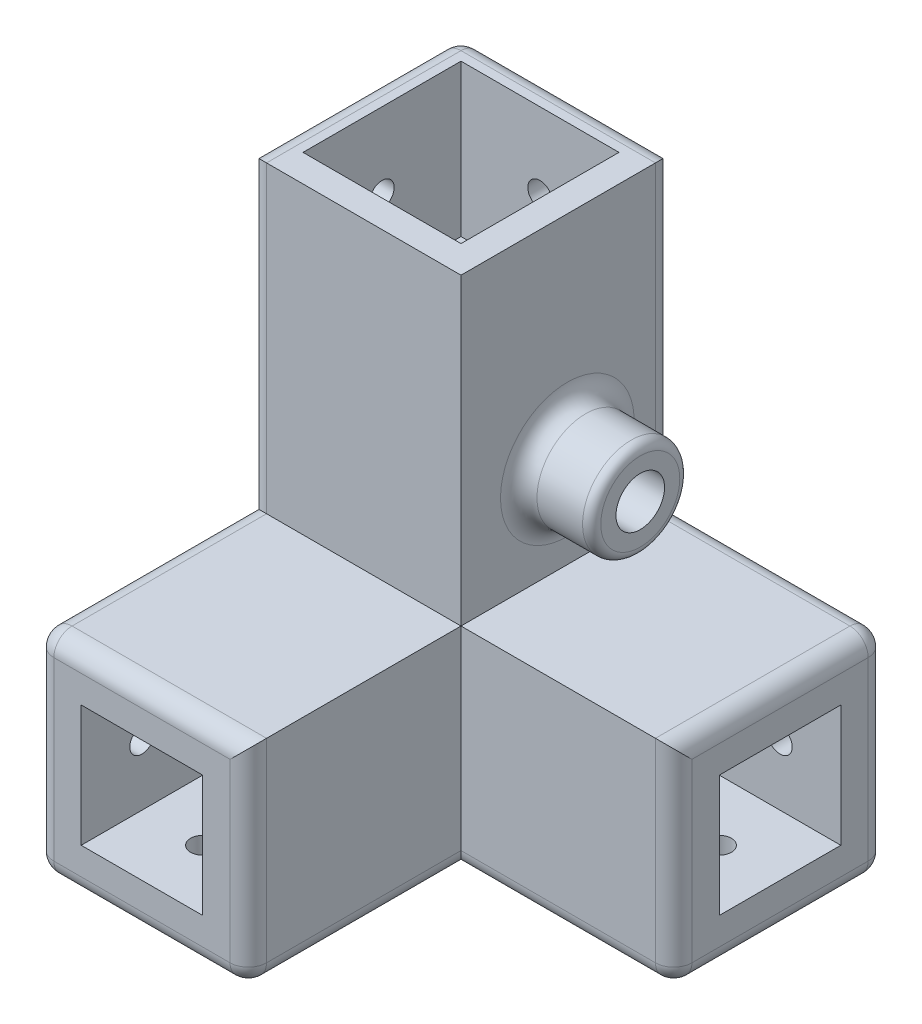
ISO-10303-21;
HEADER;
FILE_DESCRIPTION(('STEP AP214'),'2;1');
FILE_NAME('part.step','',(''),(''),'','','');
FILE_SCHEMA(('AUTOMOTIVE_DESIGN { 1 0 10303 214 1 1 1 1 }'));
ENDSEC;
DATA;
#1=APPLICATION_CONTEXT('core data for automotive mechanical design processes');
#2=APPLICATION_PROTOCOL_DEFINITION('international standard','automotive_design',2000,#1);
#3=PRODUCT_CONTEXT('',#1,'mechanical');
#4=PRODUCT('Part','Part','',(#3));
#5=PRODUCT_RELATED_PRODUCT_CATEGORY('part','',(#4));
#6=PRODUCT_DEFINITION_FORMATION('','',#4);
#7=PRODUCT_DEFINITION_CONTEXT('part definition',#1,'design');
#8=PRODUCT_DEFINITION('design','',#6,#7);
#9=PRODUCT_DEFINITION_SHAPE('','',#8);
#10=(LENGTH_UNIT() NAMED_UNIT(*) SI_UNIT(.MILLI.,.METRE.));
#11=(NAMED_UNIT(*) PLANE_ANGLE_UNIT() SI_UNIT($,.RADIAN.));
#12=(NAMED_UNIT(*) SI_UNIT($,.STERADIAN.) SOLID_ANGLE_UNIT());
#13=UNCERTAINTY_MEASURE_WITH_UNIT(LENGTH_MEASURE(1.E-05),#10,'distance_accuracy_value','');
#14=(GEOMETRIC_REPRESENTATION_CONTEXT(3) GLOBAL_UNCERTAINTY_ASSIGNED_CONTEXT((#13)) GLOBAL_UNIT_ASSIGNED_CONTEXT((#10,
#11,#12)) REPRESENTATION_CONTEXT('',''));
#15=CARTESIAN_POINT('',(0.,0.,0.));
#16=DIRECTION('',(0.,0.,1.));
#17=DIRECTION('',(1.,0.,0.));
#18=AXIS2_PLACEMENT_3D('',#15,#16,#17);
#19=CARTESIAN_POINT('',(0.,0.,35.));
#20=DIRECTION('',(0.,0.,1.));
#21=DIRECTION('',(1.,0.,0.));
#22=AXIS2_PLACEMENT_3D('',#19,#20,#21);
#23=PLANE('',#22);
#24=DIRECTION('',(-1.,0.,0.));
#25=VECTOR('',#24,1.);
#26=CARTESIAN_POINT('',(35.,85.,35.));
#27=LINE('',#26,#25);
#28=CARTESIAN_POINT('',(35.,85.,35.));
#29=VERTEX_POINT('',#28);
#30=CARTESIAN_POINT('',(3.,85.,35.));
#31=VERTEX_POINT('',#30);
#32=EDGE_CURVE('E422',#29,#31,#27,.T.);
#33=ORIENTED_EDGE('',*,*,#32,.T.);
#34=DIRECTION('',(0.,-1.,0.));
#35=VECTOR('',#34,1.);
#36=CARTESIAN_POINT('',(3.,35.,35.));
#37=LINE('',#36,#35);
#38=CARTESIAN_POINT('',(3.,35.,35.));
#39=VERTEX_POINT('',#38);
#40=EDGE_CURVE('E582',#31,#39,#37,.T.);
#41=ORIENTED_EDGE('',*,*,#40,.T.);
#42=DIRECTION('',(-1.,0.,0.));
#43=VECTOR('',#42,1.);
#44=CARTESIAN_POINT('',(0.,35.,35.));
#45=LINE('',#44,#43);
#46=CARTESIAN_POINT('',(35.,35.,35.));
#47=VERTEX_POINT('',#46);
#48=EDGE_CURVE('E414',#47,#39,#45,.T.);
#49=ORIENTED_EDGE('',*,*,#48,.F.);
#50=DIRECTION('',(0.,1.,0.));
#51=VECTOR('',#50,1.);
#52=CARTESIAN_POINT('',(35.,35.,35.));
#53=LINE('',#52,#51);
#54=EDGE_CURVE('E429',#47,#29,#53,.T.);
#55=ORIENTED_EDGE('',*,*,#54,.T.);
#56=EDGE_LOOP('',(#33,#41,#49,#55));
#57=FACE_BOUND('',#56,.T.);
#58=ADVANCED_FACE('F43',(#57),#23,.T.);
#59=CARTESIAN_POINT('',(35.,85.,35.));
#60=DIRECTION('',(0.,-1.,0.));
#61=DIRECTION('',(0.,0.,-1.));
#62=AXIS2_PLACEMENT_3D('',#59,#60,#61);
#63=PLANE('',#62);
#64=DIRECTION('',(-1.,0.,0.));
#65=VECTOR('',#64,1.);
#66=CARTESIAN_POINT('',(4.50000000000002,85.,4.5));
#67=LINE('',#66,#65);
#68=CARTESIAN_POINT('',(30.5,85.,4.5));
#69=VERTEX_POINT('',#68);
#70=CARTESIAN_POINT('',(4.50000000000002,85.,4.5));
#71=VERTEX_POINT('',#70);
#72=EDGE_CURVE('E299',#69,#71,#67,.T.);
#73=ORIENTED_EDGE('',*,*,#72,.F.);
#74=DIRECTION('',(0.,0.,-1.));
#75=VECTOR('',#74,1.);
#76=CARTESIAN_POINT('',(30.5,85.,4.5));
#77=LINE('',#76,#75);
#78=CARTESIAN_POINT('',(30.5,85.,30.5));
#79=VERTEX_POINT('',#78);
#80=EDGE_CURVE('E263',#79,#69,#77,.T.);
#81=ORIENTED_EDGE('',*,*,#80,.F.);
#82=DIRECTION('',(1.,0.,0.));
#83=VECTOR('',#82,1.);
#84=CARTESIAN_POINT('',(4.50000000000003,85.,30.5));
#85=LINE('',#84,#83);
#86=CARTESIAN_POINT('',(4.50000000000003,85.,30.5));
#87=VERTEX_POINT('',#86);
#88=EDGE_CURVE('E283',#87,#79,#85,.T.);
#89=ORIENTED_EDGE('',*,*,#88,.F.);
#90=DIRECTION('',(0.,0.,1.));
#91=VECTOR('',#90,1.);
#92=CARTESIAN_POINT('',(4.50000000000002,85.,4.5));
#93=LINE('',#92,#91);
#94=EDGE_CURVE('E287',#71,#87,#93,.T.);
#95=ORIENTED_EDGE('',*,*,#94,.F.);
#96=EDGE_LOOP('',(#73,#81,#89,#95));
#97=FACE_BOUND('',#96,.T.);
#98=DIRECTION('',(0.,0.,-1.));
#99=VECTOR('',#98,1.);
#100=CARTESIAN_POINT('',(35.,85.,35.));
#101=LINE('',#100,#99);
#102=CARTESIAN_POINT('',(35.,85.,3.));
#103=VERTEX_POINT('',#102);
#104=EDGE_CURVE('E432',#29,#103,#101,.T.);
#105=ORIENTED_EDGE('',*,*,#104,.T.);
#106=DIRECTION('',(-1.,0.,0.));
#107=VECTOR('',#106,1.);
#108=CARTESIAN_POINT('',(35.,85.,3.));
#109=LINE('',#108,#107);
#110=CARTESIAN_POINT('',(3.,85.,3.));
#111=VERTEX_POINT('',#110);
#112=EDGE_CURVE('E470',#103,#111,#109,.T.);
#113=ORIENTED_EDGE('',*,*,#112,.T.);
#114=DIRECTION('',(0.,0.,-1.));
#115=VECTOR('',#114,1.);
#116=CARTESIAN_POINT('',(3.,85.,35.));
#117=LINE('',#116,#115);
#118=EDGE_CURVE('E440',#111,#31,#117,.F.);
#119=ORIENTED_EDGE('',*,*,#118,.T.);
#120=ORIENTED_EDGE('',*,*,#32,.F.);
#121=EDGE_LOOP('',(#105,#113,#119,#120));
#122=FACE_BOUND('',#121,.T.);
#123=ADVANCED_FACE('F728',(#97,#122),#63,.F.);
#124=CARTESIAN_POINT('',(0.,85.,35.));
#125=DIRECTION('',(1.,0.,0.));
#126=DIRECTION('',(0.,1.,0.));
#127=AXIS2_PLACEMENT_3D('',#124,#125,#126);
#128=PLANE('',#127);
#129=DIRECTION('',(0.,-1.,0.));
#130=VECTOR('',#129,1.);
#131=CARTESIAN_POINT('',(0.,85.,32.));
#132=LINE('',#131,#130);
#133=CARTESIAN_POINT('',(0.,32.,32.));
#134=VERTEX_POINT('',#133);
#135=CARTESIAN_POINT('',(0.,82.,32.));
#136=VERTEX_POINT('',#135);
#137=EDGE_CURVE('E67',#134,#136,#132,.F.);
#138=ORIENTED_EDGE('',*,*,#137,.T.);
#139=DIRECTION('',(0.,0.,-1.));
#140=VECTOR('',#139,1.);
#141=CARTESIAN_POINT('',(0.,82.,35.));
#142=LINE('',#141,#140);
#143=CARTESIAN_POINT('',(0.,82.,3.));
#144=VERTEX_POINT('',#143);
#145=EDGE_CURVE('E579',#136,#144,#142,.T.);
#146=ORIENTED_EDGE('',*,*,#145,.T.);
#147=DIRECTION('',(0.,-1.,0.));
#148=VECTOR('',#147,1.);
#149=CARTESIAN_POINT('',(0.,85.,3.));
#150=LINE('',#149,#148);
#151=CARTESIAN_POINT('',(0.,3.,3.));
#152=VERTEX_POINT('',#151);
#153=EDGE_CURVE('E576',#144,#152,#150,.T.);
#154=ORIENTED_EDGE('',*,*,#153,.T.);
#155=DIRECTION('',(0.,0.,-1.));
#156=VECTOR('',#155,1.);
#157=CARTESIAN_POINT('',(0.,3.,35.));
#158=LINE('',#157,#156);
#159=CARTESIAN_POINT('',(0.,3.,67.));
#160=VERTEX_POINT('',#159);
#161=EDGE_CURVE('E565',#152,#160,#158,.F.);
#162=ORIENTED_EDGE('',*,*,#161,.T.);
#163=DIRECTION('',(0.,-1.,0.));
#164=VECTOR('',#163,1.);
#165=CARTESIAN_POINT('',(0.,85.,67.));
#166=LINE('',#165,#164);
#167=CARTESIAN_POINT('',(0.,32.,67.));
#168=VERTEX_POINT('',#167);
#169=EDGE_CURVE('E568',#160,#168,#166,.F.);
#170=ORIENTED_EDGE('',*,*,#169,.T.);
#171=DIRECTION('',(0.,0.,-1.));
#172=VECTOR('',#171,1.);
#173=CARTESIAN_POINT('',(0.,32.,35.));
#174=LINE('',#173,#172);
#175=EDGE_CURVE('E571',#168,#134,#174,.T.);
#176=ORIENTED_EDGE('',*,*,#175,.T.);
#177=EDGE_LOOP('',(#138,#146,#154,#162,#170,#176));
#178=FACE_BOUND('',#177,.T.);
#179=CARTESIAN_POINT('',(0.,72.5,17.5));
#180=DIRECTION('',(-1.,0.,0.));
#181=DIRECTION('',(0.,-1.,0.));
#182=AXIS2_PLACEMENT_3D('',#179,#180,#181);
#183=CIRCLE('',#182,2.);
#184=CARTESIAN_POINT('',(0.,70.5,17.5));
#185=VERTEX_POINT('',#184);
#186=EDGE_CURVE('E445',#185,#185,#183,.T.);
#187=ORIENTED_EDGE('',*,*,#186,.F.);
#188=EDGE_LOOP('',(#187));
#189=FACE_BOUND('',#188,.T.);
#190=CARTESIAN_POINT('',(0.,17.5,60.));
#191=DIRECTION('',(-1.,0.,0.));
#192=DIRECTION('',(0.,-1.,0.));
#193=AXIS2_PLACEMENT_3D('',#190,#191,#192);
#194=CIRCLE('',#193,2.);
#195=CARTESIAN_POINT('',(0.,15.5,60.));
#196=VERTEX_POINT('',#195);
#197=EDGE_CURVE('E290',#196,#196,#194,.T.);
#198=ORIENTED_EDGE('',*,*,#197,.F.);
#199=EDGE_LOOP('',(#198));
#200=FACE_BOUND('',#199,.T.);
#201=ADVANCED_FACE('F735',(#178,#189,#200),#128,.F.);
#202=CARTESIAN_POINT('',(0.,0.,35.));
#203=DIRECTION('',(0.,1.,0.));
#204=DIRECTION('',(0.,0.,1.));
#205=AXIS2_PLACEMENT_3D('',#202,#203,#204);
#206=PLANE('',#205);
#207=DIRECTION('',(0.,0.,-1.));
#208=VECTOR('',#207,1.);
#209=CARTESIAN_POINT('',(32.,0.,35.));
#210=LINE('',#209,#208);
#211=CARTESIAN_POINT('',(32.,0.,32.));
#212=VERTEX_POINT('',#211);
#213=CARTESIAN_POINT('',(32.,0.,67.));
#214=VERTEX_POINT('',#213);
#215=EDGE_CURVE('E518',#212,#214,#210,.F.);
#216=ORIENTED_EDGE('',*,*,#215,.T.);
#217=DIRECTION('',(1.,0.,0.));
#218=VECTOR('',#217,1.);
#219=CARTESIAN_POINT('',(0.,0.,67.));
#220=LINE('',#219,#218);
#221=CARTESIAN_POINT('',(3.,0.,67.));
#222=VERTEX_POINT('',#221);
#223=EDGE_CURVE('E521',#214,#222,#220,.F.);
#224=ORIENTED_EDGE('',*,*,#223,.T.);
#225=DIRECTION('',(0.,0.,-1.));
#226=VECTOR('',#225,1.);
#227=CARTESIAN_POINT('',(3.,0.,35.));
#228=LINE('',#227,#226);
#229=CARTESIAN_POINT('',(3.,0.,3.));
#230=VERTEX_POINT('',#229);
#231=EDGE_CURVE('E506',#222,#230,#228,.T.);
#232=ORIENTED_EDGE('',*,*,#231,.T.);
#233=DIRECTION('',(1.,0.,0.));
#234=VECTOR('',#233,1.);
#235=CARTESIAN_POINT('',(0.,0.,3.));
#236=LINE('',#235,#234);
#237=CARTESIAN_POINT('',(67.,0.,3.));
#238=VERTEX_POINT('',#237);
#239=EDGE_CURVE('E509',#230,#238,#236,.T.);
#240=ORIENTED_EDGE('',*,*,#239,.T.);
#241=DIRECTION('',(0.,0.,-1.));
#242=VECTOR('',#241,1.);
#243=CARTESIAN_POINT('',(67.,0.,35.));
#244=LINE('',#243,#242);
#245=CARTESIAN_POINT('',(67.,0.,32.));
#246=VERTEX_POINT('',#245);
#247=EDGE_CURVE('E512',#238,#246,#244,.F.);
#248=ORIENTED_EDGE('',*,*,#247,.T.);
#249=DIRECTION('',(1.,0.,0.));
#250=VECTOR('',#249,1.);
#251=CARTESIAN_POINT('',(35.,0.,32.));
#252=LINE('',#251,#250);
#253=EDGE_CURVE('E515',#246,#212,#252,.F.);
#254=ORIENTED_EDGE('',*,*,#253,.T.);
#255=EDGE_LOOP('',(#216,#224,#232,#240,#248,#254));
#256=FACE_BOUND('',#255,.T.);
#257=CARTESIAN_POINT('',(17.5,0.,60.));
#258=DIRECTION('',(0.,-1.,0.));
#259=DIRECTION('',(0.,0.,-1.));
#260=AXIS2_PLACEMENT_3D('',#257,#258,#259);
#261=CIRCLE('',#260,2.);
#262=CARTESIAN_POINT('',(17.5,0.,58.));
#263=VERTEX_POINT('',#262);
#264=EDGE_CURVE('E463',#263,#263,#261,.T.);
#265=ORIENTED_EDGE('',*,*,#264,.F.);
#266=EDGE_LOOP('',(#265));
#267=FACE_BOUND('',#266,.T.);
#268=CARTESIAN_POINT('',(60.,0.,17.5));
#269=DIRECTION('',(0.,-1.,0.));
#270=DIRECTION('',(0.,0.,-1.));
#271=AXIS2_PLACEMENT_3D('',#268,#269,#270);
#272=CIRCLE('',#271,2.);
#273=CARTESIAN_POINT('',(60.,0.,15.5));
#274=VERTEX_POINT('',#273);
#275=EDGE_CURVE('E704',#274,#274,#272,.T.);
#276=ORIENTED_EDGE('',*,*,#275,.F.);
#277=EDGE_LOOP('',(#276));
#278=FACE_BOUND('',#277,.T.);
#279=ADVANCED_FACE('F829',(#256,#267,#278),#206,.F.);
#280=CARTESIAN_POINT('',(70.,0.,35.));
#281=DIRECTION('',(-1.,0.,0.));
#282=DIRECTION('',(0.,0.,1.));
#283=AXIS2_PLACEMENT_3D('',#280,#281,#282);
#284=PLANE('',#283);
#285=DIRECTION('',(0.,0.,-1.));
#286=VECTOR('',#285,1.);
#287=CARTESIAN_POINT('',(70.,32.,35.));
#288=LINE('',#287,#286);
#289=CARTESIAN_POINT('',(70.,32.,3.));
#290=VERTEX_POINT('',#289);
#291=CARTESIAN_POINT('',(70.,32.,32.));
#292=VERTEX_POINT('',#291);
#293=EDGE_CURVE('E549',#290,#292,#288,.F.);
#294=ORIENTED_EDGE('',*,*,#293,.T.);
#295=DIRECTION('',(0.,1.,0.));
#296=VECTOR('',#295,1.);
#297=CARTESIAN_POINT('',(70.,0.,32.));
#298=LINE('',#297,#296);
#299=CARTESIAN_POINT('',(70.,3.,32.));
#300=VERTEX_POINT('',#299);
#301=EDGE_CURVE('E552',#292,#300,#298,.F.);
#302=ORIENTED_EDGE('',*,*,#301,.T.);
#303=DIRECTION('',(0.,0.,-1.));
#304=VECTOR('',#303,1.);
#305=CARTESIAN_POINT('',(70.,3.,35.));
#306=LINE('',#305,#304);
#307=CARTESIAN_POINT('',(70.,3.,3.));
#308=VERTEX_POINT('',#307);
#309=EDGE_CURVE('E546',#300,#308,#306,.T.);
#310=ORIENTED_EDGE('',*,*,#309,.T.);
#311=DIRECTION('',(0.,1.,0.));
#312=VECTOR('',#311,1.);
#313=CARTESIAN_POINT('',(70.,0.,3.));
#314=LINE('',#313,#312);
#315=EDGE_CURVE('E543',#308,#290,#314,.T.);
#316=ORIENTED_EDGE('',*,*,#315,.T.);
#317=EDGE_LOOP('',(#294,#302,#310,#316));
#318=FACE_BOUND('',#317,.T.);
#319=DIRECTION('',(0.,0.,1.));
#320=VECTOR('',#319,1.);
#321=CARTESIAN_POINT('',(70.,27.5,27.5));
#322=LINE('',#321,#320);
#323=CARTESIAN_POINT('',(70.,27.5,7.50000000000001));
#324=VERTEX_POINT('',#323);
#325=CARTESIAN_POINT('',(70.,27.5,27.5));
#326=VERTEX_POINT('',#325);
#327=EDGE_CURVE('E343',#324,#326,#322,.T.);
#328=ORIENTED_EDGE('',*,*,#327,.F.);
#329=DIRECTION('',(0.,1.,0.));
#330=VECTOR('',#329,1.);
#331=CARTESIAN_POINT('',(70.,27.5,7.50000000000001));
#332=LINE('',#331,#330);
#333=CARTESIAN_POINT('',(70.,7.5,7.5));
#334=VERTEX_POINT('',#333);
#335=EDGE_CURVE('E319',#334,#324,#332,.T.);
#336=ORIENTED_EDGE('',*,*,#335,.F.);
#337=DIRECTION('',(0.,0.,-1.));
#338=VECTOR('',#337,1.);
#339=CARTESIAN_POINT('',(70.,7.5,27.5));
#340=LINE('',#339,#338);
#341=CARTESIAN_POINT('',(70.,7.5,27.5));
#342=VERTEX_POINT('',#341);
#343=EDGE_CURVE('E328',#342,#334,#340,.T.);
#344=ORIENTED_EDGE('',*,*,#343,.F.);
#345=DIRECTION('',(0.,-1.,0.));
#346=VECTOR('',#345,1.);
#347=CARTESIAN_POINT('',(70.,27.5,27.5));
#348=LINE('',#347,#346);
#349=EDGE_CURVE('E347',#326,#342,#348,.T.);
#350=ORIENTED_EDGE('',*,*,#349,.F.);
#351=EDGE_LOOP('',(#328,#336,#344,#350));
#352=FACE_BOUND('',#351,.T.);
#353=ADVANCED_FACE('F843',(#318,#352),#284,.F.);
#354=CARTESIAN_POINT('',(70.,35.,35.));
#355=DIRECTION('',(0.,-1.,0.));
#356=DIRECTION('',(0.,0.,-1.));
#357=AXIS2_PLACEMENT_3D('',#354,#355,#356);
#358=PLANE('',#357);
#359=DIRECTION('',(-1.,0.,0.));
#360=VECTOR('',#359,1.);
#361=CARTESIAN_POINT('',(70.,35.,35.));
#362=LINE('',#361,#360);
#363=CARTESIAN_POINT('',(67.,35.,35.));
#364=VERTEX_POINT('',#363);
#365=EDGE_CURVE('E426',#364,#47,#362,.T.);
#366=ORIENTED_EDGE('',*,*,#365,.F.);
#367=DIRECTION('',(0.,0.,-1.));
#368=VECTOR('',#367,1.);
#369=CARTESIAN_POINT('',(67.,35.,35.));
#370=LINE('',#369,#368);
#371=CARTESIAN_POINT('',(67.,35.,3.));
#372=VERTEX_POINT('',#371);
#373=EDGE_CURVE('E559',#364,#372,#370,.T.);
#374=ORIENTED_EDGE('',*,*,#373,.T.);
#375=DIRECTION('',(-1.,0.,0.));
#376=VECTOR('',#375,1.);
#377=CARTESIAN_POINT('',(70.,35.,3.));
#378=LINE('',#377,#376);
#379=CARTESIAN_POINT('',(35.,35.,3.));
#380=VERTEX_POINT('',#379);
#381=EDGE_CURVE('E556',#372,#380,#378,.T.);
#382=ORIENTED_EDGE('',*,*,#381,.T.);
#383=DIRECTION('',(0.,0.,-1.));
#384=VECTOR('',#383,1.);
#385=CARTESIAN_POINT('',(35.,35.,35.));
#386=LINE('',#385,#384);
#387=EDGE_CURVE('E436',#47,#380,#386,.T.);
#388=ORIENTED_EDGE('',*,*,#387,.F.);
#389=EDGE_LOOP('',(#366,#374,#382,#388));
#390=FACE_BOUND('',#389,.T.);
#391=ADVANCED_FACE('F750',(#390),#358,.F.);
#392=CARTESIAN_POINT('',(35.,35.,35.));
#393=DIRECTION('',(-1.,0.,0.));
#394=DIRECTION('',(0.,0.,1.));
#395=AXIS2_PLACEMENT_3D('',#392,#393,#394);
#396=PLANE('',#395);
#397=CARTESIAN_POINT('',(35.,50.,17.5));
#398=DIRECTION('',(-1.,0.,0.));
#399=DIRECTION('',(0.,0.,1.));
#400=AXIS2_PLACEMENT_3D('',#397,#398,#399);
#401=CIRCLE('',#400,11.);
#402=CARTESIAN_POINT('',(35.,50.,28.5));
#403=VERTEX_POINT('',#402);
#404=EDGE_CURVE('E708',#403,#403,#401,.T.);
#405=ORIENTED_EDGE('',*,*,#404,.T.);
#406=EDGE_LOOP('',(#405));
#407=FACE_BOUND('',#406,.T.);
#408=ORIENTED_EDGE('',*,*,#387,.T.);
#409=DIRECTION('',(0.,1.,0.));
#410=VECTOR('',#409,1.);
#411=CARTESIAN_POINT('',(35.,35.,3.));
#412=LINE('',#411,#410);
#413=EDGE_CURVE('E562',#380,#103,#412,.T.);
#414=ORIENTED_EDGE('',*,*,#413,.T.);
#415=ORIENTED_EDGE('',*,*,#104,.F.);
#416=ORIENTED_EDGE('',*,*,#54,.F.);
#417=EDGE_LOOP('',(#408,#414,#415,#416));
#418=FACE_BOUND('',#417,.T.);
#419=ADVANCED_FACE('F742',(#407,#418),#396,.F.);
#420=DIRECTION('',(0.,1.,0.));
#421=VECTOR('',#420,1.);
#422=CARTESIAN_POINT('',(35.,0.,35.));
#423=LINE('',#422,#421);
#424=CARTESIAN_POINT('',(35.,3.,35.));
#425=VERTEX_POINT('',#424);
#426=EDGE_CURVE('E401',#425,#47,#423,.T.);
#427=ORIENTED_EDGE('',*,*,#426,.F.);
#428=DIRECTION('',(1.,0.,0.));
#429=VECTOR('',#428,1.);
#430=CARTESIAN_POINT('',(70.,3.,35.));
#431=LINE('',#430,#429);
#432=CARTESIAN_POINT('',(67.,3.,35.));
#433=VERTEX_POINT('',#432);
#434=EDGE_CURVE('E540',#425,#433,#431,.T.);
#435=ORIENTED_EDGE('',*,*,#434,.T.);
#436=DIRECTION('',(0.,1.,0.));
#437=VECTOR('',#436,1.);
#438=CARTESIAN_POINT('',(67.,35.,35.));
#439=LINE('',#438,#437);
#440=EDGE_CURVE('E537',#433,#364,#439,.T.);
#441=ORIENTED_EDGE('',*,*,#440,.T.);
#442=ORIENTED_EDGE('',*,*,#365,.T.);
#443=EDGE_LOOP('',(#427,#435,#441,#442));
#444=FACE_BOUND('',#443,.T.);
#445=ADVANCED_FACE('F731',(#444),#23,.T.);
#446=CARTESIAN_POINT('',(0.,0.,0.));
#447=DIRECTION('',(0.,0.,1.));
#448=DIRECTION('',(1.,0.,0.));
#449=AXIS2_PLACEMENT_3D('',#446,#447,#448);
#450=PLANE('',#449);
#451=DIRECTION('',(-1.,0.,0.));
#452=VECTOR('',#451,1.);
#453=CARTESIAN_POINT('',(0.,32.,0.));
#454=LINE('',#453,#452);
#455=CARTESIAN_POINT('',(32.,32.,0.));
#456=VERTEX_POINT('',#455);
#457=CARTESIAN_POINT('',(67.,32.,0.));
#458=VERTEX_POINT('',#457);
#459=EDGE_CURVE('E487',#456,#458,#454,.F.);
#460=ORIENTED_EDGE('',*,*,#459,.T.);
#461=DIRECTION('',(0.,1.,0.));
#462=VECTOR('',#461,1.);
#463=CARTESIAN_POINT('',(67.,0.,0.));
#464=LINE('',#463,#462);
#465=CARTESIAN_POINT('',(67.,3.,0.));
#466=VERTEX_POINT('',#465);
#467=EDGE_CURVE('E490',#458,#466,#464,.F.);
#468=ORIENTED_EDGE('',*,*,#467,.T.);
#469=DIRECTION('',(1.,0.,0.));
#470=VECTOR('',#469,1.);
#471=CARTESIAN_POINT('',(0.,3.,0.));
#472=LINE('',#471,#470);
#473=CARTESIAN_POINT('',(3.,3.,0.));
#474=VERTEX_POINT('',#473);
#475=EDGE_CURVE('E477',#466,#474,#472,.F.);
#476=ORIENTED_EDGE('',*,*,#475,.T.);
#477=DIRECTION('',(0.,-1.,0.));
#478=VECTOR('',#477,1.);
#479=CARTESIAN_POINT('',(3.,0.,0.));
#480=LINE('',#479,#478);
#481=CARTESIAN_POINT('',(3.,82.,0.));
#482=VERTEX_POINT('',#481);
#483=EDGE_CURVE('E474',#474,#482,#480,.F.);
#484=ORIENTED_EDGE('',*,*,#483,.T.);
#485=DIRECTION('',(-1.,0.,0.));
#486=VECTOR('',#485,1.);
#487=CARTESIAN_POINT('',(0.,82.,0.));
#488=LINE('',#487,#486);
#489=CARTESIAN_POINT('',(32.,82.,0.));
#490=VERTEX_POINT('',#489);
#491=EDGE_CURVE('E480',#482,#490,#488,.F.);
#492=ORIENTED_EDGE('',*,*,#491,.T.);
#493=DIRECTION('',(0.,1.,0.));
#494=VECTOR('',#493,1.);
#495=CARTESIAN_POINT('',(32.,0.,0.));
#496=LINE('',#495,#494);
#497=EDGE_CURVE('E484',#490,#456,#496,.F.);
#498=ORIENTED_EDGE('',*,*,#497,.T.);
#499=EDGE_LOOP('',(#460,#468,#476,#484,#492,#498));
#500=FACE_BOUND('',#499,.T.);
#501=CARTESIAN_POINT('',(17.5,72.5,0.));
#502=DIRECTION('',(0.,0.,-1.));
#503=DIRECTION('',(-1.,0.,0.));
#504=AXIS2_PLACEMENT_3D('',#501,#502,#503);
#505=CIRCLE('',#504,2.);
#506=CARTESIAN_POINT('',(15.5,72.5,0.));
#507=VERTEX_POINT('',#506);
#508=EDGE_CURVE('E454',#507,#507,#505,.T.);
#509=ORIENTED_EDGE('',*,*,#508,.F.);
#510=EDGE_LOOP('',(#509));
#511=FACE_BOUND('',#510,.T.);
#512=CARTESIAN_POINT('',(60.,17.5,0.));
#513=DIRECTION('',(0.,0.,-1.));
#514=DIRECTION('',(-1.,0.,0.));
#515=AXIS2_PLACEMENT_3D('',#512,#513,#514);
#516=CIRCLE('',#515,2.);
#517=CARTESIAN_POINT('',(58.,17.5,0.));
#518=VERTEX_POINT('',#517);
#519=EDGE_CURVE('E467',#518,#518,#516,.T.);
#520=ORIENTED_EDGE('',*,*,#519,.F.);
#521=EDGE_LOOP('',(#520));
#522=FACE_BOUND('',#521,.T.);
#523=ADVANCED_FACE('F741',(#500,#511,#522),#450,.F.);
#524=CARTESIAN_POINT('',(35.,0.,70.));
#525=DIRECTION('',(-1.,0.,0.));
#526=DIRECTION('',(0.,0.,1.));
#527=AXIS2_PLACEMENT_3D('',#524,#525,#526);
#528=PLANE('',#527);
#529=DIRECTION('',(0.,0.,-1.));
#530=VECTOR('',#529,1.);
#531=CARTESIAN_POINT('',(35.,35.,70.));
#532=LINE('',#531,#530);
#533=CARTESIAN_POINT('',(35.,35.,67.));
#534=VERTEX_POINT('',#533);
#535=EDGE_CURVE('E418',#534,#47,#532,.T.);
#536=ORIENTED_EDGE('',*,*,#535,.F.);
#537=DIRECTION('',(0.,1.,0.));
#538=VECTOR('',#537,1.);
#539=CARTESIAN_POINT('',(35.,0.,67.));
#540=LINE('',#539,#538);
#541=CARTESIAN_POINT('',(35.,3.,67.));
#542=VERTEX_POINT('',#541);
#543=EDGE_CURVE('E534',#534,#542,#540,.F.);
#544=ORIENTED_EDGE('',*,*,#543,.T.);
#545=DIRECTION('',(0.,0.,-1.));
#546=VECTOR('',#545,1.);
#547=CARTESIAN_POINT('',(35.,3.,70.));
#548=LINE('',#547,#546);
#549=EDGE_CURVE('E531',#542,#425,#548,.T.);
#550=ORIENTED_EDGE('',*,*,#549,.T.);
#551=ORIENTED_EDGE('',*,*,#426,.T.);
#552=EDGE_LOOP('',(#536,#544,#550,#551));
#553=FACE_BOUND('',#552,.T.);
#554=ADVANCED_FACE('F748',(#553),#528,.F.);
#555=CARTESIAN_POINT('',(0.,35.,70.));
#556=DIRECTION('',(0.,-1.,0.));
#557=DIRECTION('',(0.,0.,-1.));
#558=AXIS2_PLACEMENT_3D('',#555,#556,#557);
#559=PLANE('',#558);
#560=DIRECTION('',(0.,0.,-1.));
#561=VECTOR('',#560,1.);
#562=CARTESIAN_POINT('',(3.,35.,70.));
#563=LINE('',#562,#561);
#564=CARTESIAN_POINT('',(3.,35.,67.));
#565=VERTEX_POINT('',#564);
#566=EDGE_CURVE('E525',#39,#565,#563,.F.);
#567=ORIENTED_EDGE('',*,*,#566,.T.);
#568=DIRECTION('',(-1.,0.,0.));
#569=VECTOR('',#568,1.);
#570=CARTESIAN_POINT('',(0.,35.,67.));
#571=LINE('',#570,#569);
#572=EDGE_CURVE('E528',#565,#534,#571,.F.);
#573=ORIENTED_EDGE('',*,*,#572,.T.);
#574=ORIENTED_EDGE('',*,*,#535,.T.);
#575=ORIENTED_EDGE('',*,*,#48,.T.);
#576=EDGE_LOOP('',(#567,#573,#574,#575));
#577=FACE_BOUND('',#576,.T.);
#578=ADVANCED_FACE('F791',(#577),#559,.F.);
#579=CARTESIAN_POINT('',(0.,0.,70.));
#580=DIRECTION('',(0.,0.,-1.));
#581=DIRECTION('',(-1.,0.,0.));
#582=AXIS2_PLACEMENT_3D('',#579,#580,#581);
#583=PLANE('',#582);
#584=DIRECTION('',(1.,0.,0.));
#585=VECTOR('',#584,1.);
#586=CARTESIAN_POINT('',(0.,3.,70.));
#587=LINE('',#586,#585);
#588=CARTESIAN_POINT('',(3.,3.,70.));
#589=VERTEX_POINT('',#588);
#590=CARTESIAN_POINT('',(32.,3.,70.));
#591=VERTEX_POINT('',#590);
#592=EDGE_CURVE('E499',#589,#591,#587,.T.);
#593=ORIENTED_EDGE('',*,*,#592,.T.);
#594=DIRECTION('',(0.,1.,0.));
#595=VECTOR('',#594,1.);
#596=CARTESIAN_POINT('',(32.,0.,70.));
#597=LINE('',#596,#595);
#598=CARTESIAN_POINT('',(32.,32.,70.));
#599=VERTEX_POINT('',#598);
#600=EDGE_CURVE('E503',#591,#599,#597,.T.);
#601=ORIENTED_EDGE('',*,*,#600,.T.);
#602=DIRECTION('',(-1.,0.,0.));
#603=VECTOR('',#602,1.);
#604=CARTESIAN_POINT('',(0.,32.,70.));
#605=LINE('',#604,#603);
#606=CARTESIAN_POINT('',(3.,32.,70.));
#607=VERTEX_POINT('',#606);
#608=EDGE_CURVE('E496',#599,#607,#605,.T.);
#609=ORIENTED_EDGE('',*,*,#608,.T.);
#610=DIRECTION('',(0.,-1.,0.));
#611=VECTOR('',#610,1.);
#612=CARTESIAN_POINT('',(3.,0.,70.));
#613=LINE('',#612,#611);
#614=EDGE_CURVE('E493',#607,#589,#613,.T.);
#615=ORIENTED_EDGE('',*,*,#614,.T.);
#616=EDGE_LOOP('',(#593,#601,#609,#615));
#617=FACE_BOUND('',#616,.T.);
#618=DIRECTION('',(-1.,0.,0.));
#619=VECTOR('',#618,1.);
#620=CARTESIAN_POINT('',(7.5,27.5,70.));
#621=LINE('',#620,#619);
#622=CARTESIAN_POINT('',(27.5,27.5,70.));
#623=VERTEX_POINT('',#622);
#624=CARTESIAN_POINT('',(7.5,27.5,70.));
#625=VERTEX_POINT('',#624);
#626=EDGE_CURVE('E387',#623,#625,#621,.T.);
#627=ORIENTED_EDGE('',*,*,#626,.F.);
#628=DIRECTION('',(0.,1.,0.));
#629=VECTOR('',#628,1.);
#630=CARTESIAN_POINT('',(27.5,27.5,70.));
#631=LINE('',#630,#629);
#632=CARTESIAN_POINT('',(27.5,7.50000000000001,70.));
#633=VERTEX_POINT('',#632);
#634=EDGE_CURVE('E357',#633,#623,#631,.T.);
#635=ORIENTED_EDGE('',*,*,#634,.F.);
#636=DIRECTION('',(1.,0.,0.));
#637=VECTOR('',#636,1.);
#638=CARTESIAN_POINT('',(7.5,7.5,70.));
#639=LINE('',#638,#637);
#640=CARTESIAN_POINT('',(7.5,7.5,70.));
#641=VERTEX_POINT('',#640);
#642=EDGE_CURVE('E372',#641,#633,#639,.T.);
#643=ORIENTED_EDGE('',*,*,#642,.F.);
#644=DIRECTION('',(0.,-1.,0.));
#645=VECTOR('',#644,1.);
#646=CARTESIAN_POINT('',(7.5,27.5,70.));
#647=LINE('',#646,#645);
#648=EDGE_CURVE('E391',#625,#641,#647,.T.);
#649=ORIENTED_EDGE('',*,*,#648,.F.);
#650=EDGE_LOOP('',(#627,#635,#643,#649));
#651=FACE_BOUND('',#650,.T.);
#652=ADVANCED_FACE('F1032',(#617,#651),#583,.F.);
#653=CARTESIAN_POINT('',(27.5,27.5,50.));
#654=DIRECTION('',(1.,0.,0.));
#655=DIRECTION('',(0.,1.,0.));
#656=AXIS2_PLACEMENT_3D('',#653,#654,#655);
#657=PLANE('',#656);
#658=ORIENTED_EDGE('',*,*,#634,.T.);
#659=DIRECTION('',(0.,0.,1.));
#660=VECTOR('',#659,1.);
#661=CARTESIAN_POINT('',(27.5,27.5,50.));
#662=LINE('',#661,#660);
#663=CARTESIAN_POINT('',(27.5,27.5,50.));
#664=VERTEX_POINT('',#663);
#665=EDGE_CURVE('E384',#664,#623,#662,.T.);
#666=ORIENTED_EDGE('',*,*,#665,.F.);
#667=DIRECTION('',(0.,1.,0.));
#668=VECTOR('',#667,1.);
#669=CARTESIAN_POINT('',(27.5,27.5,50.));
#670=LINE('',#669,#668);
#671=CARTESIAN_POINT('',(27.5,7.50000000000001,50.));
#672=VERTEX_POINT('',#671);
#673=EDGE_CURVE('E367',#672,#664,#670,.T.);
#674=ORIENTED_EDGE('',*,*,#673,.F.);
#675=DIRECTION('',(0.,0.,1.));
#676=VECTOR('',#675,1.);
#677=CARTESIAN_POINT('',(27.5,7.50000000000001,50.));
#678=LINE('',#677,#676);
#679=EDGE_CURVE('E398',#672,#633,#678,.T.);
#680=ORIENTED_EDGE('',*,*,#679,.T.);
#681=EDGE_LOOP('',(#658,#666,#674,#680));
#682=FACE_BOUND('',#681,.T.);
#683=ADVANCED_FACE('F1022',(#682),#657,.F.);
#684=CARTESIAN_POINT('',(7.5,7.5,50.));
#685=DIRECTION('',(0.,-1.,0.));
#686=DIRECTION('',(1.,0.,0.));
#687=AXIS2_PLACEMENT_3D('',#684,#685,#686);
#688=PLANE('',#687);
#689=CARTESIAN_POINT('',(17.5,7.50000000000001,60.));
#690=DIRECTION('',(0.,-1.,0.));
#691=DIRECTION('',(1.,0.,0.));
#692=AXIS2_PLACEMENT_3D('',#689,#690,#691);
#693=CIRCLE('',#692,2.);
#694=CARTESIAN_POINT('',(19.5,7.50000000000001,60.));
#695=VERTEX_POINT('',#694);
#696=EDGE_CURVE('E462',#695,#695,#693,.T.);
#697=ORIENTED_EDGE('',*,*,#696,.T.);
#698=EDGE_LOOP('',(#697));
#699=FACE_BOUND('',#698,.T.);
#700=ORIENTED_EDGE('',*,*,#642,.T.);
#701=ORIENTED_EDGE('',*,*,#679,.F.);
#702=DIRECTION('',(1.,0.,0.));
#703=VECTOR('',#702,1.);
#704=CARTESIAN_POINT('',(7.5,7.5,50.));
#705=LINE('',#704,#703);
#706=CARTESIAN_POINT('',(7.5,7.5,50.));
#707=VERTEX_POINT('',#706);
#708=EDGE_CURVE('E380',#707,#672,#705,.T.);
#709=ORIENTED_EDGE('',*,*,#708,.F.);
#710=DIRECTION('',(0.,0.,1.));
#711=VECTOR('',#710,1.);
#712=CARTESIAN_POINT('',(7.5,7.5,50.));
#713=LINE('',#712,#711);
#714=EDGE_CURVE('E402',#707,#641,#713,.T.);
#715=ORIENTED_EDGE('',*,*,#714,.T.);
#716=EDGE_LOOP('',(#700,#701,#709,#715));
#717=FACE_BOUND('',#716,.T.);
#718=ADVANCED_FACE('F1018',(#699,#717),#688,.F.);
#719=CARTESIAN_POINT('',(7.5,27.5,50.));
#720=DIRECTION('',(-1.,0.,0.));
#721=DIRECTION('',(0.,-1.,0.));
#722=AXIS2_PLACEMENT_3D('',#719,#720,#721);
#723=PLANE('',#722);
#724=CARTESIAN_POINT('',(7.5,17.5,60.));
#725=DIRECTION('',(-1.,0.,0.));
#726=DIRECTION('',(0.,-1.,0.));
#727=AXIS2_PLACEMENT_3D('',#724,#725,#726);
#728=CIRCLE('',#727,2.);
#729=CARTESIAN_POINT('',(7.5,15.5,60.));
#730=VERTEX_POINT('',#729);
#731=EDGE_CURVE('E300',#730,#730,#728,.T.);
#732=ORIENTED_EDGE('',*,*,#731,.T.);
#733=EDGE_LOOP('',(#732));
#734=FACE_BOUND('',#733,.T.);
#735=ORIENTED_EDGE('',*,*,#648,.T.);
#736=ORIENTED_EDGE('',*,*,#714,.F.);
#737=DIRECTION('',(0.,-1.,0.));
#738=VECTOR('',#737,1.);
#739=CARTESIAN_POINT('',(7.5,27.5,50.));
#740=LINE('',#739,#738);
#741=CARTESIAN_POINT('',(7.5,27.5,50.));
#742=VERTEX_POINT('',#741);
#743=EDGE_CURVE('E376',#742,#707,#740,.T.);
#744=ORIENTED_EDGE('',*,*,#743,.F.);
#745=DIRECTION('',(0.,0.,1.));
#746=VECTOR('',#745,1.);
#747=CARTESIAN_POINT('',(7.5,27.5,50.));
#748=LINE('',#747,#746);
#749=EDGE_CURVE('E405',#742,#625,#748,.T.);
#750=ORIENTED_EDGE('',*,*,#749,.T.);
#751=EDGE_LOOP('',(#735,#736,#744,#750));
#752=FACE_BOUND('',#751,.T.);
#753=ADVANCED_FACE('F1021',(#734,#752),#723,.F.);
#754=CARTESIAN_POINT('',(7.5,27.5,50.));
#755=DIRECTION('',(0.,1.,0.));
#756=DIRECTION('',(-1.,0.,0.));
#757=AXIS2_PLACEMENT_3D('',#754,#755,#756);
#758=PLANE('',#757);
#759=ORIENTED_EDGE('',*,*,#626,.T.);
#760=ORIENTED_EDGE('',*,*,#749,.F.);
#761=DIRECTION('',(-1.,0.,0.));
#762=VECTOR('',#761,1.);
#763=CARTESIAN_POINT('',(7.5,27.5,50.));
#764=LINE('',#763,#762);
#765=EDGE_CURVE('E371',#664,#742,#764,.T.);
#766=ORIENTED_EDGE('',*,*,#765,.F.);
#767=ORIENTED_EDGE('',*,*,#665,.T.);
#768=EDGE_LOOP('',(#759,#760,#766,#767));
#769=FACE_BOUND('',#768,.T.);
#770=ADVANCED_FACE('F1016',(#769),#758,.F.);
#771=CARTESIAN_POINT('',(0.,0.,50.));
#772=DIRECTION('',(0.,0.,1.));
#773=DIRECTION('',(1.,0.,0.));
#774=AXIS2_PLACEMENT_3D('',#771,#772,#773);
#775=PLANE('',#774);
#776=ORIENTED_EDGE('',*,*,#673,.T.);
#777=ORIENTED_EDGE('',*,*,#765,.T.);
#778=ORIENTED_EDGE('',*,*,#743,.T.);
#779=ORIENTED_EDGE('',*,*,#708,.T.);
#780=EDGE_LOOP('',(#776,#777,#778,#779));
#781=FACE_BOUND('',#780,.T.);
#782=ADVANCED_FACE('F1012',(#781),#775,.T.);
#783=CARTESIAN_POINT('',(50.,27.5,7.50000000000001));
#784=DIRECTION('',(0.,0.,-1.));
#785=DIRECTION('',(0.,1.,0.));
#786=AXIS2_PLACEMENT_3D('',#783,#784,#785);
#787=PLANE('',#786);
#788=CARTESIAN_POINT('',(60.,17.5,7.5));
#789=DIRECTION('',(0.,0.,-1.));
#790=DIRECTION('',(0.,1.,0.));
#791=AXIS2_PLACEMENT_3D('',#788,#789,#790);
#792=CIRCLE('',#791,2.);
#793=CARTESIAN_POINT('',(60.,19.5,7.50000000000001));
#794=VERTEX_POINT('',#793);
#795=EDGE_CURVE('E453',#794,#794,#792,.T.);
#796=ORIENTED_EDGE('',*,*,#795,.T.);
#797=EDGE_LOOP('',(#796));
#798=FACE_BOUND('',#797,.T.);
#799=ORIENTED_EDGE('',*,*,#335,.T.);
#800=DIRECTION('',(1.,0.,0.));
#801=VECTOR('',#800,1.);
#802=CARTESIAN_POINT('',(50.,27.5,7.50000000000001));
#803=LINE('',#802,#801);
#804=CARTESIAN_POINT('',(50.,27.5,7.50000000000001));
#805=VERTEX_POINT('',#804);
#806=EDGE_CURVE('E340',#805,#324,#803,.T.);
#807=ORIENTED_EDGE('',*,*,#806,.F.);
#808=DIRECTION('',(0.,1.,0.));
#809=VECTOR('',#808,1.);
#810=CARTESIAN_POINT('',(50.,27.5,7.50000000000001));
#811=LINE('',#810,#809);
#812=CARTESIAN_POINT('',(50.,7.5,7.5));
#813=VERTEX_POINT('',#812);
#814=EDGE_CURVE('E323',#813,#805,#811,.T.);
#815=ORIENTED_EDGE('',*,*,#814,.F.);
#816=DIRECTION('',(1.,0.,0.));
#817=VECTOR('',#816,1.);
#818=CARTESIAN_POINT('',(50.,7.5,7.5));
#819=LINE('',#818,#817);
#820=EDGE_CURVE('E354',#813,#334,#819,.T.);
#821=ORIENTED_EDGE('',*,*,#820,.T.);
#822=EDGE_LOOP('',(#799,#807,#815,#821));
#823=FACE_BOUND('',#822,.T.);
#824=ADVANCED_FACE('F1002',(#798,#823),#787,.F.);
#825=CARTESIAN_POINT('',(50.,7.5,27.5));
#826=DIRECTION('',(0.,-1.,0.));
#827=DIRECTION('',(0.,0.,-1.));
#828=AXIS2_PLACEMENT_3D('',#825,#826,#827);
#829=PLANE('',#828);
#830=CARTESIAN_POINT('',(60.,7.5,17.5));
#831=DIRECTION('',(0.,-1.,0.));
#832=DIRECTION('',(0.,0.,-1.));
#833=AXIS2_PLACEMENT_3D('',#830,#831,#832);
#834=CIRCLE('',#833,2.);
#835=CARTESIAN_POINT('',(60.,7.5,15.5));
#836=VERTEX_POINT('',#835);
#837=EDGE_CURVE('E458',#836,#836,#834,.T.);
#838=ORIENTED_EDGE('',*,*,#837,.T.);
#839=EDGE_LOOP('',(#838));
#840=FACE_BOUND('',#839,.T.);
#841=ORIENTED_EDGE('',*,*,#343,.T.);
#842=ORIENTED_EDGE('',*,*,#820,.F.);
#843=DIRECTION('',(0.,0.,-1.));
#844=VECTOR('',#843,1.);
#845=CARTESIAN_POINT('',(50.,7.5,27.5));
#846=LINE('',#845,#844);
#847=CARTESIAN_POINT('',(50.,7.5,27.5));
#848=VERTEX_POINT('',#847);
#849=EDGE_CURVE('E336',#848,#813,#846,.T.);
#850=ORIENTED_EDGE('',*,*,#849,.F.);
#851=DIRECTION('',(1.,0.,0.));
#852=VECTOR('',#851,1.);
#853=CARTESIAN_POINT('',(50.,7.5,27.5));
#854=LINE('',#853,#852);
#855=EDGE_CURVE('E358',#848,#342,#854,.T.);
#856=ORIENTED_EDGE('',*,*,#855,.T.);
#857=EDGE_LOOP('',(#841,#842,#850,#856));
#858=FACE_BOUND('',#857,.T.);
#859=ADVANCED_FACE('F998',(#840,#858),#829,.F.);
#860=CARTESIAN_POINT('',(50.,27.5,27.5));
#861=DIRECTION('',(0.,0.,1.));
#862=DIRECTION('',(0.,-1.,0.));
#863=AXIS2_PLACEMENT_3D('',#860,#861,#862);
#864=PLANE('',#863);
#865=ORIENTED_EDGE('',*,*,#349,.T.);
#866=ORIENTED_EDGE('',*,*,#855,.F.);
#867=DIRECTION('',(0.,-1.,0.));
#868=VECTOR('',#867,1.);
#869=CARTESIAN_POINT('',(50.,27.5,27.5));
#870=LINE('',#869,#868);
#871=CARTESIAN_POINT('',(50.,27.5,27.5));
#872=VERTEX_POINT('',#871);
#873=EDGE_CURVE('E332',#872,#848,#870,.T.);
#874=ORIENTED_EDGE('',*,*,#873,.F.);
#875=DIRECTION('',(1.,0.,0.));
#876=VECTOR('',#875,1.);
#877=CARTESIAN_POINT('',(50.,27.5,27.5));
#878=LINE('',#877,#876);
#879=EDGE_CURVE('E361',#872,#326,#878,.T.);
#880=ORIENTED_EDGE('',*,*,#879,.T.);
#881=EDGE_LOOP('',(#865,#866,#874,#880));
#882=FACE_BOUND('',#881,.T.);
#883=ADVANCED_FACE('F1001',(#882),#864,.F.);
#884=CARTESIAN_POINT('',(50.,27.5,27.5));
#885=DIRECTION('',(0.,1.,0.));
#886=DIRECTION('',(0.,0.,1.));
#887=AXIS2_PLACEMENT_3D('',#884,#885,#886);
#888=PLANE('',#887);
#889=ORIENTED_EDGE('',*,*,#327,.T.);
#890=ORIENTED_EDGE('',*,*,#879,.F.);
#891=DIRECTION('',(0.,0.,1.));
#892=VECTOR('',#891,1.);
#893=CARTESIAN_POINT('',(50.,27.5,27.5));
#894=LINE('',#893,#892);
#895=EDGE_CURVE('E327',#805,#872,#894,.T.);
#896=ORIENTED_EDGE('',*,*,#895,.F.);
#897=ORIENTED_EDGE('',*,*,#806,.T.);
#898=EDGE_LOOP('',(#889,#890,#896,#897));
#899=FACE_BOUND('',#898,.T.);
#900=ADVANCED_FACE('F996',(#899),#888,.F.);
#901=CARTESIAN_POINT('',(50.,0.,0.));
#902=DIRECTION('',(1.,0.,0.));
#903=DIRECTION('',(0.,0.,-1.));
#904=AXIS2_PLACEMENT_3D('',#901,#902,#903);
#905=PLANE('',#904);
#906=ORIENTED_EDGE('',*,*,#814,.T.);
#907=ORIENTED_EDGE('',*,*,#895,.T.);
#908=ORIENTED_EDGE('',*,*,#873,.T.);
#909=ORIENTED_EDGE('',*,*,#849,.T.);
#910=EDGE_LOOP('',(#906,#907,#908,#909));
#911=FACE_BOUND('',#910,.T.);
#912=ADVANCED_FACE('F992',(#911),#905,.T.);
#913=CARTESIAN_POINT('',(47.,50.,17.5));
#914=DIRECTION('',(-1.,0.,0.));
#915=DIRECTION('',(0.,0.,1.));
#916=AXIS2_PLACEMENT_3D('',#913,#914,#915);
#917=CYLINDRICAL_SURFACE('',#916,8.);
#918=CARTESIAN_POINT('',(45.5,50.,17.5));
#919=DIRECTION('',(1.,0.,0.));
#920=DIRECTION('',(0.,0.,-1.));
#921=AXIS2_PLACEMENT_3D('',#918,#919,#920);
#922=CIRCLE('',#921,8.);
#923=CARTESIAN_POINT('',(45.5,50.,9.5));
#924=VERTEX_POINT('',#923);
#925=EDGE_CURVE('E11',#924,#924,#922,.F.);
#926=ORIENTED_EDGE('',*,*,#925,.T.);
#927=EDGE_LOOP('',(#926));
#928=FACE_BOUND('',#927,.T.);
#929=CARTESIAN_POINT('',(38.,50.,17.5));
#930=DIRECTION('',(-1.,0.,0.));
#931=DIRECTION('',(0.,0.,1.));
#932=AXIS2_PLACEMENT_3D('',#929,#930,#931);
#933=CIRCLE('',#932,8.);
#934=CARTESIAN_POINT('',(38.,50.,25.5));
#935=VERTEX_POINT('',#934);
#936=EDGE_CURVE('E585',#935,#935,#933,.F.);
#937=ORIENTED_EDGE('',*,*,#936,.T.);
#938=EDGE_LOOP('',(#937));
#939=FACE_BOUND('',#938,.T.);
#940=ADVANCED_FACE('F989',(#928,#939),#917,.T.);
#941=CARTESIAN_POINT('',(47.,50.,17.5));
#942=DIRECTION('',(1.,0.,0.));
#943=DIRECTION('',(0.,0.,-1.));
#944=AXIS2_PLACEMENT_3D('',#941,#942,#943);
#945=PLANE('',#944);
#946=CARTESIAN_POINT('',(47.,50.,17.5));
#947=DIRECTION('',(1.,0.,0.));
#948=DIRECTION('',(0.,0.,-1.));
#949=AXIS2_PLACEMENT_3D('',#946,#947,#948);
#950=CIRCLE('',#949,6.5);
#951=CARTESIAN_POINT('',(47.,50.,11.));
#952=VERTEX_POINT('',#951);
#953=EDGE_CURVE('E52',#952,#952,#950,.T.);
#954=ORIENTED_EDGE('',*,*,#953,.T.);
#955=EDGE_LOOP('',(#954));
#956=FACE_BOUND('',#955,.T.);
#957=CARTESIAN_POINT('',(47.,50.,17.5));
#958=DIRECTION('',(1.,0.,0.));
#959=DIRECTION('',(0.,0.,-1.));
#960=AXIS2_PLACEMENT_3D('',#957,#958,#959);
#961=CIRCLE('',#960,4.);
#962=CARTESIAN_POINT('',(47.,50.,13.5));
#963=VERTEX_POINT('',#962);
#964=EDGE_CURVE('E309',#963,#963,#961,.T.);
#965=ORIENTED_EDGE('',*,*,#964,.F.);
#966=EDGE_LOOP('',(#965));
#967=FACE_BOUND('',#966,.T.);
#968=ADVANCED_FACE('F715',(#956,#967),#945,.T.);
#969=CARTESIAN_POINT('',(22.,50.,17.5));
#970=DIRECTION('',(1.,0.,0.));
#971=DIRECTION('',(0.,0.,-1.));
#972=AXIS2_PLACEMENT_3D('',#969,#970,#971);
#973=CYLINDRICAL_SURFACE('',#972,4.);
#974=CARTESIAN_POINT('',(22.,50.,17.5));
#975=DIRECTION('',(1.,0.,0.));
#976=DIRECTION('',(0.,0.,-1.));
#977=AXIS2_PLACEMENT_3D('',#974,#975,#976);
#978=CIRCLE('',#977,4.);
#979=CARTESIAN_POINT('',(22.,50.,13.5));
#980=VERTEX_POINT('',#979);
#981=EDGE_CURVE('E315',#980,#980,#978,.T.);
#982=ORIENTED_EDGE('',*,*,#981,.F.);
#983=EDGE_LOOP('',(#982));
#984=FACE_BOUND('',#983,.T.);
#985=ORIENTED_EDGE('',*,*,#964,.T.);
#986=EDGE_LOOP('',(#985));
#987=FACE_BOUND('',#986,.T.);
#988=ADVANCED_FACE('F982',(#984,#987),#973,.F.);
#989=CARTESIAN_POINT('',(22.,50.,17.5));
#990=DIRECTION('',(1.,0.,0.));
#991=DIRECTION('',(0.,0.,-1.));
#992=AXIS2_PLACEMENT_3D('',#989,#990,#991);
#993=PLANE('',#992);
#994=ORIENTED_EDGE('',*,*,#981,.T.);
#995=EDGE_LOOP('',(#994));
#996=FACE_BOUND('',#995,.T.);
#997=ADVANCED_FACE('F979',(#996),#993,.T.);
#998=CARTESIAN_POINT('',(30.5,60.,4.5));
#999=DIRECTION('',(1.,0.,0.));
#1000=DIRECTION('',(0.,1.,0.));
#1001=AXIS2_PLACEMENT_3D('',#998,#999,#1000);
#1002=PLANE('',#1001);
#1003=ORIENTED_EDGE('',*,*,#80,.T.);
#1004=DIRECTION('',(0.,1.,0.));
#1005=VECTOR('',#1004,1.);
#1006=CARTESIAN_POINT('',(30.5,60.,4.5));
#1007=LINE('',#1006,#1005);
#1008=CARTESIAN_POINT('',(30.5,60.,4.5));
#1009=VERTEX_POINT('',#1008);
#1010=EDGE_CURVE('E256',#1009,#69,#1007,.T.);
#1011=ORIENTED_EDGE('',*,*,#1010,.F.);
#1012=DIRECTION('',(0.,0.,-1.));
#1013=VECTOR('',#1012,1.);
#1014=CARTESIAN_POINT('',(30.5,60.,4.5));
#1015=LINE('',#1014,#1013);
#1016=CARTESIAN_POINT('',(30.5,60.,30.5));
#1017=VERTEX_POINT('',#1016);
#1018=EDGE_CURVE('E260',#1017,#1009,#1015,.T.);
#1019=ORIENTED_EDGE('',*,*,#1018,.F.);
#1020=DIRECTION('',(0.,1.,0.));
#1021=VECTOR('',#1020,1.);
#1022=CARTESIAN_POINT('',(30.5,60.,30.5));
#1023=LINE('',#1022,#1021);
#1024=EDGE_CURVE('E306',#1017,#79,#1023,.T.);
#1025=ORIENTED_EDGE('',*,*,#1024,.T.);
#1026=EDGE_LOOP('',(#1003,#1011,#1019,#1025));
#1027=FACE_BOUND('',#1026,.T.);
#1028=ADVANCED_FACE('F258',(#1027),#1002,.F.);
#1029=CARTESIAN_POINT('',(4.50000000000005,60.,30.5));
#1030=DIRECTION('',(0.,0.,1.));
#1031=DIRECTION('',(1.,0.,0.));
#1032=AXIS2_PLACEMENT_3D('',#1029,#1030,#1031);
#1033=PLANE('',#1032);
#1034=ORIENTED_EDGE('',*,*,#88,.T.);
#1035=ORIENTED_EDGE('',*,*,#1024,.F.);
#1036=DIRECTION('',(1.,0.,0.));
#1037=VECTOR('',#1036,1.);
#1038=CARTESIAN_POINT('',(4.50000000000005,60.,30.5));
#1039=LINE('',#1038,#1037);
#1040=CARTESIAN_POINT('',(4.50000000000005,60.,30.5));
#1041=VERTEX_POINT('',#1040);
#1042=EDGE_CURVE('E269',#1041,#1017,#1039,.T.);
#1043=ORIENTED_EDGE('',*,*,#1042,.F.);
#1044=DIRECTION('',(0.,1.,0.));
#1045=VECTOR('',#1044,1.);
#1046=CARTESIAN_POINT('',(4.50000000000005,60.,30.5));
#1047=LINE('',#1046,#1045);
#1048=EDGE_CURVE('E310',#1041,#87,#1047,.T.);
#1049=ORIENTED_EDGE('',*,*,#1048,.T.);
#1050=EDGE_LOOP('',(#1034,#1035,#1043,#1049));
#1051=FACE_BOUND('',#1050,.T.);
#1052=ADVANCED_FACE('F966',(#1051),#1033,.F.);
#1053=CARTESIAN_POINT('',(4.50000000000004,60.,4.5));
#1054=DIRECTION('',(-1.,0.,0.));
#1055=DIRECTION('',(0.,-1.,0.));
#1056=AXIS2_PLACEMENT_3D('',#1053,#1054,#1055);
#1057=PLANE('',#1056);
#1058=CARTESIAN_POINT('',(4.50000000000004,72.5,17.5));
#1059=DIRECTION('',(-1.,0.,0.));
#1060=DIRECTION('',(0.,-1.,0.));
#1061=AXIS2_PLACEMENT_3D('',#1058,#1059,#1060);
#1062=CIRCLE('',#1061,2.);
#1063=CARTESIAN_POINT('',(4.50000000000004,70.5,17.5));
#1064=VERTEX_POINT('',#1063);
#1065=EDGE_CURVE('E441',#1064,#1064,#1062,.T.);
#1066=ORIENTED_EDGE('',*,*,#1065,.T.);
#1067=EDGE_LOOP('',(#1066));
#1068=FACE_BOUND('',#1067,.T.);
#1069=ORIENTED_EDGE('',*,*,#94,.T.);
#1070=ORIENTED_EDGE('',*,*,#1048,.F.);
#1071=DIRECTION('',(0.,0.,1.));
#1072=VECTOR('',#1071,1.);
#1073=CARTESIAN_POINT('',(4.50000000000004,60.,4.5));
#1074=LINE('',#1073,#1072);
#1075=CARTESIAN_POINT('',(4.50000000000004,60.,4.5));
#1076=VERTEX_POINT('',#1075);
#1077=EDGE_CURVE('E278',#1076,#1041,#1074,.T.);
#1078=ORIENTED_EDGE('',*,*,#1077,.F.);
#1079=DIRECTION('',(0.,1.,0.));
#1080=VECTOR('',#1079,1.);
#1081=CARTESIAN_POINT('',(4.50000000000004,60.,4.5));
#1082=LINE('',#1081,#1080);
#1083=EDGE_CURVE('E268',#1076,#71,#1082,.T.);
#1084=ORIENTED_EDGE('',*,*,#1083,.T.);
#1085=EDGE_LOOP('',(#1069,#1070,#1078,#1084));
#1086=FACE_BOUND('',#1085,.T.);
#1087=ADVANCED_FACE('F969',(#1068,#1086),#1057,.F.);
#1088=CARTESIAN_POINT('',(4.50000000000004,60.,4.5));
#1089=DIRECTION('',(0.,0.,-1.));
#1090=DIRECTION('',(-1.,0.,0.));
#1091=AXIS2_PLACEMENT_3D('',#1088,#1089,#1090);
#1092=PLANE('',#1091);
#1093=CARTESIAN_POINT('',(17.5,72.5,4.5));
#1094=DIRECTION('',(0.,0.,-1.));
#1095=DIRECTION('',(-1.,0.,0.));
#1096=AXIS2_PLACEMENT_3D('',#1093,#1094,#1095);
#1097=CIRCLE('',#1096,2.);
#1098=CARTESIAN_POINT('',(15.5,72.5,4.5));
#1099=VERTEX_POINT('',#1098);
#1100=EDGE_CURVE('E449',#1099,#1099,#1097,.T.);
#1101=ORIENTED_EDGE('',*,*,#1100,.T.);
#1102=EDGE_LOOP('',(#1101));
#1103=FACE_BOUND('',#1102,.T.);
#1104=ORIENTED_EDGE('',*,*,#72,.T.);
#1105=ORIENTED_EDGE('',*,*,#1083,.F.);
#1106=DIRECTION('',(-1.,0.,0.));
#1107=VECTOR('',#1106,1.);
#1108=CARTESIAN_POINT('',(4.50000000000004,60.,4.5));
#1109=LINE('',#1108,#1107);
#1110=EDGE_CURVE('E272',#1009,#1076,#1109,.T.);
#1111=ORIENTED_EDGE('',*,*,#1110,.F.);
#1112=ORIENTED_EDGE('',*,*,#1010,.T.);
#1113=EDGE_LOOP('',(#1104,#1105,#1111,#1112));
#1114=FACE_BOUND('',#1113,.T.);
#1115=ADVANCED_FACE('F273',(#1103,#1114),#1092,.F.);
#1116=CARTESIAN_POINT('',(0.,60.,0.));
#1117=DIRECTION('',(0.,1.,0.));
#1118=DIRECTION('',(-1.,0.,0.));
#1119=AXIS2_PLACEMENT_3D('',#1116,#1117,#1118);
#1120=PLANE('',#1119);
#1121=ORIENTED_EDGE('',*,*,#1018,.T.);
#1122=ORIENTED_EDGE('',*,*,#1110,.T.);
#1123=ORIENTED_EDGE('',*,*,#1077,.T.);
#1124=ORIENTED_EDGE('',*,*,#1042,.T.);
#1125=EDGE_LOOP('',(#1121,#1122,#1123,#1124));
#1126=FACE_BOUND('',#1125,.T.);
#1127=ADVANCED_FACE('F280',(#1126),#1120,.T.);
#1128=CARTESIAN_POINT('',(10.,72.5,17.5));
#1129=DIRECTION('',(-1.,0.,0.));
#1130=DIRECTION('',(0.,-1.,0.));
#1131=AXIS2_PLACEMENT_3D('',#1128,#1129,#1130);
#1132=CYLINDRICAL_SURFACE('',#1131,2.);
#1133=ORIENTED_EDGE('',*,*,#186,.T.);
#1134=EDGE_LOOP('',(#1133));
#1135=FACE_BOUND('',#1134,.T.);
#1136=ORIENTED_EDGE('',*,*,#1065,.F.);
#1137=EDGE_LOOP('',(#1136));
#1138=FACE_BOUND('',#1137,.T.);
#1139=ADVANCED_FACE('F957',(#1135,#1138),#1132,.F.);
#1140=CARTESIAN_POINT('',(10.,17.5,60.));
#1141=DIRECTION('',(-1.,0.,0.));
#1142=DIRECTION('',(0.,-1.,0.));
#1143=AXIS2_PLACEMENT_3D('',#1140,#1141,#1142);
#1144=CYLINDRICAL_SURFACE('',#1143,2.);
#1145=ORIENTED_EDGE('',*,*,#197,.T.);
#1146=EDGE_LOOP('',(#1145));
#1147=FACE_BOUND('',#1146,.T.);
#1148=ORIENTED_EDGE('',*,*,#731,.F.);
#1149=EDGE_LOOP('',(#1148));
#1150=FACE_BOUND('',#1149,.T.);
#1151=ADVANCED_FACE('F952',(#1147,#1150),#1144,.F.);
#1152=CARTESIAN_POINT('',(17.5,72.5,10.));
#1153=DIRECTION('',(0.,0.,-1.));
#1154=DIRECTION('',(-1.,0.,0.));
#1155=AXIS2_PLACEMENT_3D('',#1152,#1153,#1154);
#1156=CYLINDRICAL_SURFACE('',#1155,2.);
#1157=ORIENTED_EDGE('',*,*,#508,.T.);
#1158=EDGE_LOOP('',(#1157));
#1159=FACE_BOUND('',#1158,.T.);
#1160=ORIENTED_EDGE('',*,*,#1100,.F.);
#1161=EDGE_LOOP('',(#1160));
#1162=FACE_BOUND('',#1161,.T.);
#1163=ADVANCED_FACE('F949',(#1159,#1162),#1156,.F.);
#1164=CARTESIAN_POINT('',(60.,17.5,10.));
#1165=DIRECTION('',(0.,0.,-1.));
#1166=DIRECTION('',(-1.,0.,0.));
#1167=AXIS2_PLACEMENT_3D('',#1164,#1165,#1166);
#1168=CYLINDRICAL_SURFACE('',#1167,2.);
#1169=ORIENTED_EDGE('',*,*,#519,.T.);
#1170=EDGE_LOOP('',(#1169));
#1171=FACE_BOUND('',#1170,.T.);
#1172=ORIENTED_EDGE('',*,*,#795,.F.);
#1173=EDGE_LOOP('',(#1172));
#1174=FACE_BOUND('',#1173,.T.);
#1175=ADVANCED_FACE('F943',(#1171,#1174),#1168,.F.);
#1176=CARTESIAN_POINT('',(60.,10.,17.5));
#1177=DIRECTION('',(0.,-1.,0.));
#1178=DIRECTION('',(0.,0.,-1.));
#1179=AXIS2_PLACEMENT_3D('',#1176,#1177,#1178);
#1180=CYLINDRICAL_SURFACE('',#1179,2.);
#1181=ORIENTED_EDGE('',*,*,#275,.T.);
#1182=EDGE_LOOP('',(#1181));
#1183=FACE_BOUND('',#1182,.T.);
#1184=ORIENTED_EDGE('',*,*,#837,.F.);
#1185=EDGE_LOOP('',(#1184));
#1186=FACE_BOUND('',#1185,.T.);
#1187=ADVANCED_FACE('F937',(#1183,#1186),#1180,.F.);
#1188=CARTESIAN_POINT('',(17.5,10.,60.));
#1189=DIRECTION('',(0.,-1.,0.));
#1190=DIRECTION('',(0.,0.,-1.));
#1191=AXIS2_PLACEMENT_3D('',#1188,#1189,#1190);
#1192=CYLINDRICAL_SURFACE('',#1191,2.);
#1193=ORIENTED_EDGE('',*,*,#264,.T.);
#1194=EDGE_LOOP('',(#1193));
#1195=FACE_BOUND('',#1194,.T.);
#1196=ORIENTED_EDGE('',*,*,#696,.F.);
#1197=EDGE_LOOP('',(#1196));
#1198=FACE_BOUND('',#1197,.T.);
#1199=ADVANCED_FACE('F933',(#1195,#1198),#1192,.F.);
#1200=CARTESIAN_POINT('',(32.,3.,70.));
#1201=DIRECTION('',(0.,0.,-1.));
#1202=DIRECTION('',(-1.,0.,0.));
#1203=AXIS2_PLACEMENT_3D('',#1200,#1201,#1202);
#1204=CYLINDRICAL_SURFACE('',#1203,3.);
#1205=CARTESIAN_POINT('',(32.,3.,67.));
#1206=DIRECTION('',(0.,0.,1.));
#1207=DIRECTION('',(1.,0.,0.));
#1208=AXIS2_PLACEMENT_3D('',#1205,#1206,#1207);
#1209=CIRCLE('',#1208,3.);
#1210=EDGE_CURVE('E692',#214,#542,#1209,.T.);
#1211=ORIENTED_EDGE('',*,*,#1210,.F.);
#1212=ORIENTED_EDGE('',*,*,#215,.F.);
#1213=CARTESIAN_POINT('',(32.,3.,32.));
#1214=DIRECTION('',(0.707106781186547,0.,-0.707106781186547));
#1215=DIRECTION('',(-0.707106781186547,0.,-0.707106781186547));
#1216=AXIS2_PLACEMENT_3D('',#1213,#1214,#1215);
#1217=ELLIPSE('',#1216,4.24264068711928,3.);
#1218=EDGE_CURVE('E700',#425,#212,#1217,.T.);
#1219=ORIENTED_EDGE('',*,*,#1218,.F.);
#1220=ORIENTED_EDGE('',*,*,#549,.F.);
#1221=EDGE_LOOP('',(#1211,#1212,#1219,#1220));
#1222=FACE_BOUND('',#1221,.T.);
#1223=ADVANCED_FACE('F764',(#1222),#1204,.T.);
#1224=CARTESIAN_POINT('',(0.,3.,32.));
#1225=DIRECTION('',(-1.,0.,0.));
#1226=DIRECTION('',(0.,0.,1.));
#1227=AXIS2_PLACEMENT_3D('',#1224,#1225,#1226);
#1228=CYLINDRICAL_SURFACE('',#1227,3.);
#1229=ORIENTED_EDGE('',*,*,#1218,.T.);
#1230=ORIENTED_EDGE('',*,*,#253,.F.);
#1231=CARTESIAN_POINT('',(67.,3.,32.));
#1232=DIRECTION('',(1.,0.,0.));
#1233=DIRECTION('',(0.,0.,-1.));
#1234=AXIS2_PLACEMENT_3D('',#1231,#1232,#1233);
#1235=CIRCLE('',#1234,3.);
#1236=EDGE_CURVE('E688',#433,#246,#1235,.T.);
#1237=ORIENTED_EDGE('',*,*,#1236,.F.);
#1238=ORIENTED_EDGE('',*,*,#434,.F.);
#1239=EDGE_LOOP('',(#1229,#1230,#1237,#1238));
#1240=FACE_BOUND('',#1239,.T.);
#1241=ADVANCED_FACE('F768',(#1240),#1228,.T.);
#1242=CARTESIAN_POINT('',(32.,0.,67.));
#1243=DIRECTION('',(0.,1.,0.));
#1244=DIRECTION('',(0.,0.,1.));
#1245=AXIS2_PLACEMENT_3D('',#1242,#1243,#1244);
#1246=CYLINDRICAL_SURFACE('',#1245,3.);
#1247=CARTESIAN_POINT('',(32.,3.,67.));
#1248=DIRECTION('',(0.,-1.,0.));
#1249=DIRECTION('',(0.,0.,-1.));
#1250=AXIS2_PLACEMENT_3D('',#1247,#1248,#1249);
#1251=CIRCLE('',#1250,3.);
#1252=EDGE_CURVE('E696',#542,#591,#1251,.T.);
#1253=ORIENTED_EDGE('',*,*,#1252,.F.);
#1254=ORIENTED_EDGE('',*,*,#543,.F.);
#1255=CARTESIAN_POINT('',(32.,32.,67.));
#1256=DIRECTION('',(-0.707106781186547,0.707106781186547,0.));
#1257=DIRECTION('',(0.707106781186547,0.707106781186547,0.));
#1258=AXIS2_PLACEMENT_3D('',#1255,#1256,#1257);
#1259=ELLIPSE('',#1258,4.24264068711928,3.);
#1260=EDGE_CURVE('E684',#599,#534,#1259,.T.);
#1261=ORIENTED_EDGE('',*,*,#1260,.F.);
#1262=ORIENTED_EDGE('',*,*,#600,.F.);
#1263=EDGE_LOOP('',(#1253,#1254,#1261,#1262));
#1264=FACE_BOUND('',#1263,.T.);
#1265=ADVANCED_FACE('F925',(#1264),#1246,.T.);
#1266=CARTESIAN_POINT('',(32.,3.,67.));
#1267=DIRECTION('',(1.,0.,0.));
#1268=DIRECTION('',(0.,0.,-1.));
#1269=AXIS2_PLACEMENT_3D('',#1266,#1267,#1268);
#1270=SPHERICAL_SURFACE('',#1269,3.);
#1271=ORIENTED_EDGE('',*,*,#1210,.T.);
#1272=ORIENTED_EDGE('',*,*,#1252,.T.);
#1273=CARTESIAN_POINT('',(32.,3.,67.));
#1274=DIRECTION('',(1.,0.,0.));
#1275=DIRECTION('',(0.,0.,-1.));
#1276=AXIS2_PLACEMENT_3D('',#1273,#1274,#1275);
#1277=CIRCLE('',#1276,3.);
#1278=EDGE_CURVE('E681',#214,#591,#1277,.F.);
#1279=ORIENTED_EDGE('',*,*,#1278,.F.);
#1280=EDGE_LOOP('',(#1271,#1272,#1279));
#1281=FACE_BOUND('',#1280,.T.);
#1282=ADVANCED_FACE('F922',(#1281),#1270,.T.);
#1283=CARTESIAN_POINT('',(67.,3.,32.));
#1284=DIRECTION('',(0.,-1.,0.));
#1285=DIRECTION('',(0.,0.,-1.));
#1286=AXIS2_PLACEMENT_3D('',#1283,#1284,#1285);
#1287=SPHERICAL_SURFACE('',#1286,3.);
#1288=CARTESIAN_POINT('',(67.,3.,32.));
#1289=DIRECTION('',(0.,-1.,0.));
#1290=DIRECTION('',(0.,0.,-1.));
#1291=AXIS2_PLACEMENT_3D('',#1288,#1289,#1290);
#1292=CIRCLE('',#1291,3.);
#1293=EDGE_CURVE('E673',#433,#300,#1292,.F.);
#1294=ORIENTED_EDGE('',*,*,#1293,.F.);
#1295=ORIENTED_EDGE('',*,*,#1236,.T.);
#1296=CARTESIAN_POINT('',(67.,3.,32.));
#1297=DIRECTION('',(0.,0.,1.));
#1298=DIRECTION('',(1.,0.,0.));
#1299=AXIS2_PLACEMENT_3D('',#1296,#1297,#1298);
#1300=CIRCLE('',#1299,3.);
#1301=EDGE_CURVE('E677',#300,#246,#1300,.F.);
#1302=ORIENTED_EDGE('',*,*,#1301,.F.);
#1303=EDGE_LOOP('',(#1294,#1295,#1302));
#1304=FACE_BOUND('',#1303,.T.);
#1305=ADVANCED_FACE('F773',(#1304),#1287,.T.);
#1306=CARTESIAN_POINT('',(0.,32.,67.));
#1307=DIRECTION('',(-1.,0.,0.));
#1308=DIRECTION('',(0.,0.,1.));
#1309=AXIS2_PLACEMENT_3D('',#1306,#1307,#1308);
#1310=CYLINDRICAL_SURFACE('',#1309,3.);
#1311=ORIENTED_EDGE('',*,*,#1260,.T.);
#1312=ORIENTED_EDGE('',*,*,#572,.F.);
#1313=CARTESIAN_POINT('',(3.,32.,67.));
#1314=DIRECTION('',(-1.,0.,0.));
#1315=DIRECTION('',(0.,-1.,0.));
#1316=AXIS2_PLACEMENT_3D('',#1313,#1314,#1315);
#1317=CIRCLE('',#1316,3.);
#1318=EDGE_CURVE('E669',#607,#565,#1317,.T.);
#1319=ORIENTED_EDGE('',*,*,#1318,.F.);
#1320=ORIENTED_EDGE('',*,*,#608,.F.);
#1321=EDGE_LOOP('',(#1311,#1312,#1319,#1320));
#1322=FACE_BOUND('',#1321,.T.);
#1323=ADVANCED_FACE('F915',(#1322),#1310,.T.);
#1324=CARTESIAN_POINT('',(3.,0.,67.));
#1325=DIRECTION('',(0.,-1.,0.));
#1326=DIRECTION('',(1.,0.,0.));
#1327=AXIS2_PLACEMENT_3D('',#1324,#1325,#1326);
#1328=CYLINDRICAL_SURFACE('',#1327,3.);
#1329=CARTESIAN_POINT('',(3.,3.,67.));
#1330=DIRECTION('',(0.,-1.,0.));
#1331=DIRECTION('',(0.,0.,-1.));
#1332=AXIS2_PLACEMENT_3D('',#1329,#1330,#1331);
#1333=CIRCLE('',#1332,3.);
#1334=EDGE_CURVE('E661',#589,#160,#1333,.T.);
#1335=ORIENTED_EDGE('',*,*,#1334,.F.);
#1336=ORIENTED_EDGE('',*,*,#614,.F.);
#1337=CARTESIAN_POINT('',(3.,32.,67.));
#1338=DIRECTION('',(0.,1.,0.));
#1339=DIRECTION('',(0.,0.,1.));
#1340=AXIS2_PLACEMENT_3D('',#1337,#1338,#1339);
#1341=CIRCLE('',#1340,3.);
#1342=EDGE_CURVE('E665',#168,#607,#1341,.T.);
#1343=ORIENTED_EDGE('',*,*,#1342,.F.);
#1344=ORIENTED_EDGE('',*,*,#169,.F.);
#1345=EDGE_LOOP('',(#1335,#1336,#1343,#1344));
#1346=FACE_BOUND('',#1345,.T.);
#1347=ADVANCED_FACE('F911',(#1346),#1328,.T.);
#1348=CARTESIAN_POINT('',(0.,3.,67.));
#1349=DIRECTION('',(1.,0.,0.));
#1350=DIRECTION('',(0.,0.,-1.));
#1351=AXIS2_PLACEMENT_3D('',#1348,#1349,#1350);
#1352=CYLINDRICAL_SURFACE('',#1351,3.);
#1353=ORIENTED_EDGE('',*,*,#1278,.T.);
#1354=ORIENTED_EDGE('',*,*,#592,.F.);
#1355=CARTESIAN_POINT('',(3.,3.,67.));
#1356=DIRECTION('',(-1.,0.,0.));
#1357=DIRECTION('',(0.,0.,1.));
#1358=AXIS2_PLACEMENT_3D('',#1355,#1356,#1357);
#1359=CIRCLE('',#1358,3.);
#1360=EDGE_CURVE('E657',#222,#589,#1359,.T.);
#1361=ORIENTED_EDGE('',*,*,#1360,.F.);
#1362=ORIENTED_EDGE('',*,*,#223,.F.);
#1363=EDGE_LOOP('',(#1353,#1354,#1361,#1362));
#1364=FACE_BOUND('',#1363,.T.);
#1365=ADVANCED_FACE('F908',(#1364),#1352,.T.);
#1366=CARTESIAN_POINT('',(67.,3.,35.));
#1367=DIRECTION('',(0.,0.,-1.));
#1368=DIRECTION('',(-1.,0.,0.));
#1369=AXIS2_PLACEMENT_3D('',#1366,#1367,#1368);
#1370=CYLINDRICAL_SURFACE('',#1369,3.);
#1371=ORIENTED_EDGE('',*,*,#1301,.T.);
#1372=ORIENTED_EDGE('',*,*,#247,.F.);
#1373=CARTESIAN_POINT('',(67.,3.,3.));
#1374=DIRECTION('',(0.,0.,-1.));
#1375=DIRECTION('',(-1.,0.,0.));
#1376=AXIS2_PLACEMENT_3D('',#1373,#1374,#1375);
#1377=CIRCLE('',#1376,3.);
#1378=EDGE_CURVE('E653',#308,#238,#1377,.T.);
#1379=ORIENTED_EDGE('',*,*,#1378,.F.);
#1380=ORIENTED_EDGE('',*,*,#309,.F.);
#1381=EDGE_LOOP('',(#1371,#1372,#1379,#1380));
#1382=FACE_BOUND('',#1381,.T.);
#1383=ADVANCED_FACE('F833',(#1382),#1370,.T.);
#1384=CARTESIAN_POINT('',(67.,0.,32.));
#1385=DIRECTION('',(0.,-1.,0.));
#1386=DIRECTION('',(0.,0.,-1.));
#1387=AXIS2_PLACEMENT_3D('',#1384,#1385,#1386);
#1388=CYLINDRICAL_SURFACE('',#1387,3.);
#1389=ORIENTED_EDGE('',*,*,#1293,.T.);
#1390=ORIENTED_EDGE('',*,*,#301,.F.);
#1391=CARTESIAN_POINT('',(67.,32.,32.));
#1392=DIRECTION('',(0.,0.707106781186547,-0.707106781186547));
#1393=DIRECTION('',(0.,-0.707106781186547,-0.707106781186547));
#1394=AXIS2_PLACEMENT_3D('',#1391,#1392,#1393);
#1395=ELLIPSE('',#1394,4.24264068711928,3.);
#1396=EDGE_CURVE('E645',#364,#292,#1395,.T.);
#1397=ORIENTED_EDGE('',*,*,#1396,.F.);
#1398=ORIENTED_EDGE('',*,*,#440,.F.);
#1399=EDGE_LOOP('',(#1389,#1390,#1397,#1398));
#1400=FACE_BOUND('',#1399,.T.);
#1401=ADVANCED_FACE('F777',(#1400),#1388,.T.);
#1402=CARTESIAN_POINT('',(3.,32.,67.));
#1403=DIRECTION('',(0.,0.,1.));
#1404=DIRECTION('',(1.,0.,0.));
#1405=AXIS2_PLACEMENT_3D('',#1402,#1403,#1404);
#1406=SPHERICAL_SURFACE('',#1405,3.);
#1407=ORIENTED_EDGE('',*,*,#1342,.T.);
#1408=ORIENTED_EDGE('',*,*,#1318,.T.);
#1409=CARTESIAN_POINT('',(3.,32.,67.));
#1410=DIRECTION('',(0.,0.,1.));
#1411=DIRECTION('',(1.,0.,0.));
#1412=AXIS2_PLACEMENT_3D('',#1409,#1410,#1411);
#1413=CIRCLE('',#1412,3.);
#1414=EDGE_CURVE('E641',#168,#565,#1413,.F.);
#1415=ORIENTED_EDGE('',*,*,#1414,.F.);
#1416=EDGE_LOOP('',(#1407,#1408,#1415));
#1417=FACE_BOUND('',#1416,.T.);
#1418=ADVANCED_FACE('F899',(#1417),#1406,.T.);
#1419=CARTESIAN_POINT('',(3.,3.,67.));
#1420=DIRECTION('',(0.,0.,1.));
#1421=DIRECTION('',(1.,0.,0.));
#1422=AXIS2_PLACEMENT_3D('',#1419,#1420,#1421);
#1423=SPHERICAL_SURFACE('',#1422,3.);
#1424=ORIENTED_EDGE('',*,*,#1360,.T.);
#1425=ORIENTED_EDGE('',*,*,#1334,.T.);
#1426=CARTESIAN_POINT('',(3.,3.,67.));
#1427=DIRECTION('',(0.,0.,1.));
#1428=DIRECTION('',(1.,0.,0.));
#1429=AXIS2_PLACEMENT_3D('',#1426,#1427,#1428);
#1430=CIRCLE('',#1429,3.);
#1431=EDGE_CURVE('E637',#222,#160,#1430,.F.);
#1432=ORIENTED_EDGE('',*,*,#1431,.F.);
#1433=EDGE_LOOP('',(#1424,#1425,#1432));
#1434=FACE_BOUND('',#1433,.T.);
#1435=ADVANCED_FACE('F896',(#1434),#1423,.T.);
#1436=CARTESIAN_POINT('',(67.,3.,3.));
#1437=DIRECTION('',(1.,0.,0.));
#1438=DIRECTION('',(0.,0.,-1.));
#1439=AXIS2_PLACEMENT_3D('',#1436,#1437,#1438);
#1440=SPHERICAL_SURFACE('',#1439,3.);
#1441=CARTESIAN_POINT('',(67.,3.,3.));
#1442=DIRECTION('',(1.,0.,0.));
#1443=DIRECTION('',(0.,0.,-1.));
#1444=AXIS2_PLACEMENT_3D('',#1441,#1442,#1443);
#1445=CIRCLE('',#1444,3.);
#1446=EDGE_CURVE('E633',#466,#238,#1445,.F.);
#1447=ORIENTED_EDGE('',*,*,#1446,.F.);
#1448=CARTESIAN_POINT('',(67.,3.,3.));
#1449=DIRECTION('',(0.,-1.,0.));
#1450=DIRECTION('',(0.,0.,-1.));
#1451=AXIS2_PLACEMENT_3D('',#1448,#1449,#1450);
#1452=CIRCLE('',#1451,3.);
#1453=EDGE_CURVE('E649',#308,#466,#1452,.F.);
#1454=ORIENTED_EDGE('',*,*,#1453,.F.);
#1455=ORIENTED_EDGE('',*,*,#1378,.T.);
#1456=EDGE_LOOP('',(#1447,#1454,#1455));
#1457=FACE_BOUND('',#1456,.T.);
#1458=ADVANCED_FACE('F836',(#1457),#1440,.T.);
#1459=CARTESIAN_POINT('',(67.,0.,3.));
#1460=DIRECTION('',(0.,1.,0.));
#1461=DIRECTION('',(0.,0.,1.));
#1462=AXIS2_PLACEMENT_3D('',#1459,#1460,#1461);
#1463=CYLINDRICAL_SURFACE('',#1462,3.);
#1464=ORIENTED_EDGE('',*,*,#1453,.T.);
#1465=ORIENTED_EDGE('',*,*,#467,.F.);
#1466=CARTESIAN_POINT('',(67.,32.,3.));
#1467=DIRECTION('',(0.,1.,0.));
#1468=DIRECTION('',(0.,0.,1.));
#1469=AXIS2_PLACEMENT_3D('',#1466,#1467,#1468);
#1470=CIRCLE('',#1469,3.);
#1471=EDGE_CURVE('E629',#290,#458,#1470,.T.);
#1472=ORIENTED_EDGE('',*,*,#1471,.F.);
#1473=ORIENTED_EDGE('',*,*,#315,.F.);
#1474=EDGE_LOOP('',(#1464,#1465,#1472,#1473));
#1475=FACE_BOUND('',#1474,.T.);
#1476=ADVANCED_FACE('F840',(#1475),#1463,.T.);
#1477=CARTESIAN_POINT('',(67.,32.,35.));
#1478=DIRECTION('',(0.,0.,-1.));
#1479=DIRECTION('',(-1.,0.,0.));
#1480=AXIS2_PLACEMENT_3D('',#1477,#1478,#1479);
#1481=CYLINDRICAL_SURFACE('',#1480,3.);
#1482=ORIENTED_EDGE('',*,*,#1396,.T.);
#1483=ORIENTED_EDGE('',*,*,#293,.F.);
#1484=CARTESIAN_POINT('',(67.,32.,3.));
#1485=DIRECTION('',(0.,0.,-1.));
#1486=DIRECTION('',(-1.,0.,0.));
#1487=AXIS2_PLACEMENT_3D('',#1484,#1485,#1486);
#1488=CIRCLE('',#1487,3.);
#1489=EDGE_CURVE('E625',#372,#290,#1488,.T.);
#1490=ORIENTED_EDGE('',*,*,#1489,.F.);
#1491=ORIENTED_EDGE('',*,*,#373,.F.);
#1492=EDGE_LOOP('',(#1482,#1483,#1490,#1491));
#1493=FACE_BOUND('',#1492,.T.);
#1494=ADVANCED_FACE('F846',(#1493),#1481,.T.);
#1495=CARTESIAN_POINT('',(3.,32.,35.));
#1496=DIRECTION('',(0.,0.,-1.));
#1497=DIRECTION('',(-1.,0.,0.));
#1498=AXIS2_PLACEMENT_3D('',#1495,#1496,#1497);
#1499=CYLINDRICAL_SURFACE('',#1498,3.);
#1500=ORIENTED_EDGE('',*,*,#1414,.T.);
#1501=ORIENTED_EDGE('',*,*,#566,.F.);
#1502=CARTESIAN_POINT('',(3.,32.,32.));
#1503=DIRECTION('',(0.,0.707106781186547,-0.707106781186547));
#1504=DIRECTION('',(0.,0.707106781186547,0.707106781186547));
#1505=AXIS2_PLACEMENT_3D('',#1502,#1503,#1504);
#1506=ELLIPSE('',#1505,4.24264068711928,3.);
#1507=EDGE_CURVE('E621',#134,#39,#1506,.T.);
#1508=ORIENTED_EDGE('',*,*,#1507,.F.);
#1509=ORIENTED_EDGE('',*,*,#175,.F.);
#1510=EDGE_LOOP('',(#1500,#1501,#1508,#1509));
#1511=FACE_BOUND('',#1510,.T.);
#1512=ADVANCED_FACE('F795',(#1511),#1499,.T.);
#1513=CARTESIAN_POINT('',(3.,3.,35.));
#1514=DIRECTION('',(0.,0.,-1.));
#1515=DIRECTION('',(-1.,0.,0.));
#1516=AXIS2_PLACEMENT_3D('',#1513,#1514,#1515);
#1517=CYLINDRICAL_SURFACE('',#1516,3.);
#1518=ORIENTED_EDGE('',*,*,#1431,.T.);
#1519=ORIENTED_EDGE('',*,*,#161,.F.);
#1520=CARTESIAN_POINT('',(3.,3.,3.));
#1521=DIRECTION('',(0.,0.,-1.));
#1522=DIRECTION('',(-1.,0.,0.));
#1523=AXIS2_PLACEMENT_3D('',#1520,#1521,#1522);
#1524=CIRCLE('',#1523,3.);
#1525=EDGE_CURVE('E617',#230,#152,#1524,.T.);
#1526=ORIENTED_EDGE('',*,*,#1525,.F.);
#1527=ORIENTED_EDGE('',*,*,#231,.F.);
#1528=EDGE_LOOP('',(#1518,#1519,#1526,#1527));
#1529=FACE_BOUND('',#1528,.T.);
#1530=ADVANCED_FACE('F811',(#1529),#1517,.T.);
#1531=CARTESIAN_POINT('',(0.,3.,3.));
#1532=DIRECTION('',(1.,0.,0.));
#1533=DIRECTION('',(0.,0.,-1.));
#1534=AXIS2_PLACEMENT_3D('',#1531,#1532,#1533);
#1535=CYLINDRICAL_SURFACE('',#1534,3.);
#1536=ORIENTED_EDGE('',*,*,#1446,.T.);
#1537=ORIENTED_EDGE('',*,*,#239,.F.);
#1538=CARTESIAN_POINT('',(3.,3.,3.));
#1539=DIRECTION('',(-1.,0.,0.));
#1540=DIRECTION('',(0.,0.,1.));
#1541=AXIS2_PLACEMENT_3D('',#1538,#1539,#1540);
#1542=CIRCLE('',#1541,3.);
#1543=EDGE_CURVE('E613',#474,#230,#1542,.T.);
#1544=ORIENTED_EDGE('',*,*,#1543,.F.);
#1545=ORIENTED_EDGE('',*,*,#475,.F.);
#1546=EDGE_LOOP('',(#1536,#1537,#1544,#1545));
#1547=FACE_BOUND('',#1546,.T.);
#1548=ADVANCED_FACE('F825',(#1547),#1535,.T.);
#1549=CARTESIAN_POINT('',(67.,32.,3.));
#1550=DIRECTION('',(1.,0.,0.));
#1551=DIRECTION('',(0.,0.,-1.));
#1552=AXIS2_PLACEMENT_3D('',#1549,#1550,#1551);
#1553=SPHERICAL_SURFACE('',#1552,3.);
#1554=ORIENTED_EDGE('',*,*,#1489,.T.);
#1555=ORIENTED_EDGE('',*,*,#1471,.T.);
#1556=CARTESIAN_POINT('',(67.,32.,3.));
#1557=DIRECTION('',(1.,0.,0.));
#1558=DIRECTION('',(0.,0.,-1.));
#1559=AXIS2_PLACEMENT_3D('',#1556,#1557,#1558);
#1560=CIRCLE('',#1559,3.);
#1561=EDGE_CURVE('E609',#372,#458,#1560,.F.);
#1562=ORIENTED_EDGE('',*,*,#1561,.F.);
#1563=EDGE_LOOP('',(#1554,#1555,#1562));
#1564=FACE_BOUND('',#1563,.T.);
#1565=ADVANCED_FACE('F849',(#1564),#1553,.T.);
#1566=CARTESIAN_POINT('',(3.,0.,32.));
#1567=DIRECTION('',(0.,1.,0.));
#1568=DIRECTION('',(-1.,0.,0.));
#1569=AXIS2_PLACEMENT_3D('',#1566,#1567,#1568);
#1570=CYLINDRICAL_SURFACE('',#1569,3.);
#1571=ORIENTED_EDGE('',*,*,#1507,.T.);
#1572=ORIENTED_EDGE('',*,*,#40,.F.);
#1573=CARTESIAN_POINT('',(3.,82.,32.));
#1574=DIRECTION('',(0.,0.707106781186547,-0.707106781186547));
#1575=DIRECTION('',(0.,0.707106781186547,0.707106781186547));
#1576=AXIS2_PLACEMENT_3D('',#1573,#1574,#1575);
#1577=ELLIPSE('',#1576,4.24264068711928,3.);
#1578=EDGE_CURVE('E605',#136,#31,#1577,.T.);
#1579=ORIENTED_EDGE('',*,*,#1578,.F.);
#1580=ORIENTED_EDGE('',*,*,#137,.F.);
#1581=EDGE_LOOP('',(#1571,#1572,#1579,#1580));
#1582=FACE_BOUND('',#1581,.T.);
#1583=ADVANCED_FACE('F799',(#1582),#1570,.T.);
#1584=CARTESIAN_POINT('',(3.,3.,3.));
#1585=DIRECTION('',(0.,-1.,0.));
#1586=DIRECTION('',(0.,0.,-1.));
#1587=AXIS2_PLACEMENT_3D('',#1584,#1585,#1586);
#1588=SPHERICAL_SURFACE('',#1587,3.);
#1589=ORIENTED_EDGE('',*,*,#1543,.T.);
#1590=ORIENTED_EDGE('',*,*,#1525,.T.);
#1591=CARTESIAN_POINT('',(3.,3.,3.));
#1592=DIRECTION('',(0.,-1.,0.));
#1593=DIRECTION('',(0.,0.,-1.));
#1594=AXIS2_PLACEMENT_3D('',#1591,#1592,#1593);
#1595=CIRCLE('',#1594,3.);
#1596=EDGE_CURVE('E601',#474,#152,#1595,.F.);
#1597=ORIENTED_EDGE('',*,*,#1596,.F.);
#1598=EDGE_LOOP('',(#1589,#1590,#1597));
#1599=FACE_BOUND('',#1598,.T.);
#1600=ADVANCED_FACE('F815',(#1599),#1588,.T.);
#1601=CARTESIAN_POINT('',(70.,32.,3.));
#1602=DIRECTION('',(-1.,0.,0.));
#1603=DIRECTION('',(0.,0.,1.));
#1604=AXIS2_PLACEMENT_3D('',#1601,#1602,#1603);
#1605=CYLINDRICAL_SURFACE('',#1604,3.);
#1606=ORIENTED_EDGE('',*,*,#1561,.T.);
#1607=ORIENTED_EDGE('',*,*,#459,.F.);
#1608=CARTESIAN_POINT('',(32.,32.,3.));
#1609=DIRECTION('',(-0.707106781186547,0.707106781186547,0.));
#1610=DIRECTION('',(-0.707106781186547,-0.707106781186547,0.));
#1611=AXIS2_PLACEMENT_3D('',#1608,#1609,#1610);
#1612=ELLIPSE('',#1611,4.24264068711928,3.);
#1613=EDGE_CURVE('E597',#380,#456,#1612,.T.);
#1614=ORIENTED_EDGE('',*,*,#1613,.F.);
#1615=ORIENTED_EDGE('',*,*,#381,.F.);
#1616=EDGE_LOOP('',(#1606,#1607,#1614,#1615));
#1617=FACE_BOUND('',#1616,.T.);
#1618=ADVANCED_FACE('F852',(#1617),#1605,.T.);
#1619=CARTESIAN_POINT('',(3.,82.,35.));
#1620=DIRECTION('',(0.,0.,-1.));
#1621=DIRECTION('',(-1.,0.,0.));
#1622=AXIS2_PLACEMENT_3D('',#1619,#1620,#1621);
#1623=CYLINDRICAL_SURFACE('',#1622,3.);
#1624=ORIENTED_EDGE('',*,*,#1578,.T.);
#1625=ORIENTED_EDGE('',*,*,#118,.F.);
#1626=CARTESIAN_POINT('',(3.,82.,3.));
#1627=DIRECTION('',(0.,0.,-1.));
#1628=DIRECTION('',(-1.,0.,0.));
#1629=AXIS2_PLACEMENT_3D('',#1626,#1627,#1628);
#1630=CIRCLE('',#1629,3.);
#1631=EDGE_CURVE('E594',#144,#111,#1630,.T.);
#1632=ORIENTED_EDGE('',*,*,#1631,.F.);
#1633=ORIENTED_EDGE('',*,*,#145,.F.);
#1634=EDGE_LOOP('',(#1624,#1625,#1632,#1633));
#1635=FACE_BOUND('',#1634,.T.);
#1636=ADVANCED_FACE('F803',(#1635),#1623,.T.);
#1637=CARTESIAN_POINT('',(3.,85.,3.));
#1638=DIRECTION('',(0.,-1.,0.));
#1639=DIRECTION('',(1.,0.,0.));
#1640=AXIS2_PLACEMENT_3D('',#1637,#1638,#1639);
#1641=CYLINDRICAL_SURFACE('',#1640,3.);
#1642=ORIENTED_EDGE('',*,*,#1596,.T.);
#1643=ORIENTED_EDGE('',*,*,#153,.F.);
#1644=CARTESIAN_POINT('',(3.,82.,3.));
#1645=DIRECTION('',(0.,1.,0.));
#1646=DIRECTION('',(0.,0.,1.));
#1647=AXIS2_PLACEMENT_3D('',#1644,#1645,#1646);
#1648=CIRCLE('',#1647,3.);
#1649=EDGE_CURVE('E59',#482,#144,#1648,.T.);
#1650=ORIENTED_EDGE('',*,*,#1649,.F.);
#1651=ORIENTED_EDGE('',*,*,#483,.F.);
#1652=EDGE_LOOP('',(#1642,#1643,#1650,#1651));
#1653=FACE_BOUND('',#1652,.T.);
#1654=ADVANCED_FACE('F818',(#1653),#1641,.T.);
#1655=CARTESIAN_POINT('',(32.,35.,3.));
#1656=DIRECTION('',(0.,1.,0.));
#1657=DIRECTION('',(0.,0.,1.));
#1658=AXIS2_PLACEMENT_3D('',#1655,#1656,#1657);
#1659=CYLINDRICAL_SURFACE('',#1658,3.);
#1660=ORIENTED_EDGE('',*,*,#1613,.T.);
#1661=ORIENTED_EDGE('',*,*,#497,.F.);
#1662=CARTESIAN_POINT('',(32.,82.,3.));
#1663=DIRECTION('',(-0.707106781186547,0.707106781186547,0.));
#1664=DIRECTION('',(0.707106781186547,0.707106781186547,0.));
#1665=AXIS2_PLACEMENT_3D('',#1662,#1663,#1664);
#1666=ELLIPSE('',#1665,4.24264068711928,3.);
#1667=EDGE_CURVE('E589',#103,#490,#1666,.T.);
#1668=ORIENTED_EDGE('',*,*,#1667,.F.);
#1669=ORIENTED_EDGE('',*,*,#413,.F.);
#1670=EDGE_LOOP('',(#1660,#1661,#1668,#1669));
#1671=FACE_BOUND('',#1670,.T.);
#1672=ADVANCED_FACE('F857',(#1671),#1659,.T.);
#1673=CARTESIAN_POINT('',(3.,82.,3.));
#1674=DIRECTION('',(-1.,0.,0.));
#1675=DIRECTION('',(0.,0.,1.));
#1676=AXIS2_PLACEMENT_3D('',#1673,#1674,#1675);
#1677=SPHERICAL_SURFACE('',#1676,3.);
#1678=ORIENTED_EDGE('',*,*,#1649,.T.);
#1679=ORIENTED_EDGE('',*,*,#1631,.T.);
#1680=CARTESIAN_POINT('',(3.,82.,3.));
#1681=DIRECTION('',(-1.,0.,0.));
#1682=DIRECTION('',(0.,0.,1.));
#1683=AXIS2_PLACEMENT_3D('',#1680,#1681,#1682);
#1684=CIRCLE('',#1683,3.);
#1685=EDGE_CURVE('E586',#482,#111,#1684,.F.);
#1686=ORIENTED_EDGE('',*,*,#1685,.F.);
#1687=EDGE_LOOP('',(#1678,#1679,#1686));
#1688=FACE_BOUND('',#1687,.T.);
#1689=ADVANCED_FACE('F862',(#1688),#1677,.T.);
#1690=CARTESIAN_POINT('',(35.,82.,3.));
#1691=DIRECTION('',(-1.,0.,0.));
#1692=DIRECTION('',(0.,0.,1.));
#1693=AXIS2_PLACEMENT_3D('',#1690,#1691,#1692);
#1694=CYLINDRICAL_SURFACE('',#1693,3.);
#1695=ORIENTED_EDGE('',*,*,#1667,.T.);
#1696=ORIENTED_EDGE('',*,*,#491,.F.);
#1697=ORIENTED_EDGE('',*,*,#1685,.T.);
#1698=ORIENTED_EDGE('',*,*,#112,.F.);
#1699=EDGE_LOOP('',(#1695,#1696,#1697,#1698));
#1700=FACE_BOUND('',#1699,.T.);
#1701=ADVANCED_FACE('F724',(#1700),#1694,.T.);
#1702=CARTESIAN_POINT('',(38.,50.,17.5));
#1703=DIRECTION('',(-1.,0.,0.));
#1704=DIRECTION('',(0.,0.,1.));
#1705=AXIS2_PLACEMENT_3D('',#1702,#1703,#1704);
#1706=TOROIDAL_SURFACE('',#1705,11.,3.);
#1707=ORIENTED_EDGE('',*,*,#404,.F.);
#1708=EDGE_LOOP('',(#1707));
#1709=FACE_BOUND('',#1708,.T.);
#1710=ORIENTED_EDGE('',*,*,#936,.F.);
#1711=EDGE_LOOP('',(#1710));
#1712=FACE_BOUND('',#1711,.T.);
#1713=ADVANCED_FACE('F719',(#1709,#1712),#1706,.F.);
#1714=CARTESIAN_POINT('',(45.5,50.,17.5));
#1715=DIRECTION('',(1.,0.,0.));
#1716=DIRECTION('',(0.,0.,-1.));
#1717=AXIS2_PLACEMENT_3D('',#1714,#1715,#1716);
#1718=TOROIDAL_SURFACE('',#1717,6.5,1.5);
#1719=ORIENTED_EDGE('',*,*,#925,.F.);
#1720=EDGE_LOOP('',(#1719));
#1721=FACE_BOUND('',#1720,.T.);
#1722=ORIENTED_EDGE('',*,*,#953,.F.);
#1723=EDGE_LOOP('',(#1722));
#1724=FACE_BOUND('',#1723,.T.);
#1725=ADVANCED_FACE('F45',(#1721,#1724),#1718,.T.);
#1726=CLOSED_SHELL('',(#58,#123,#201,#279,#353,#391,#419,#445,#523,#554,#578,#652,#683,#718,
#753,#770,#782,#824,#859,#883,#900,#912,#940,#968,#988,#997,#1028,#1052,#1087,#1115,#1127,#1139,
#1151,#1163,#1175,#1187,#1199,#1223,#1241,#1265,#1282,#1305,#1323,#1347,#1365,#1383,#1401,#1418,
#1435,#1458,#1476,#1494,#1512,#1530,#1548,#1565,#1583,#1600,#1618,#1636,#1654,#1672,#1689,#1701,
#1713,#1725));
#1727=MANIFOLD_SOLID_BREP('B2',#1726);
#1728=ADVANCED_BREP_SHAPE_REPRESENTATION('',(#18,#1727),#14);
#1729=SHAPE_DEFINITION_REPRESENTATION(#9,#1728);
ENDSEC;
END-ISO-10303-21;
